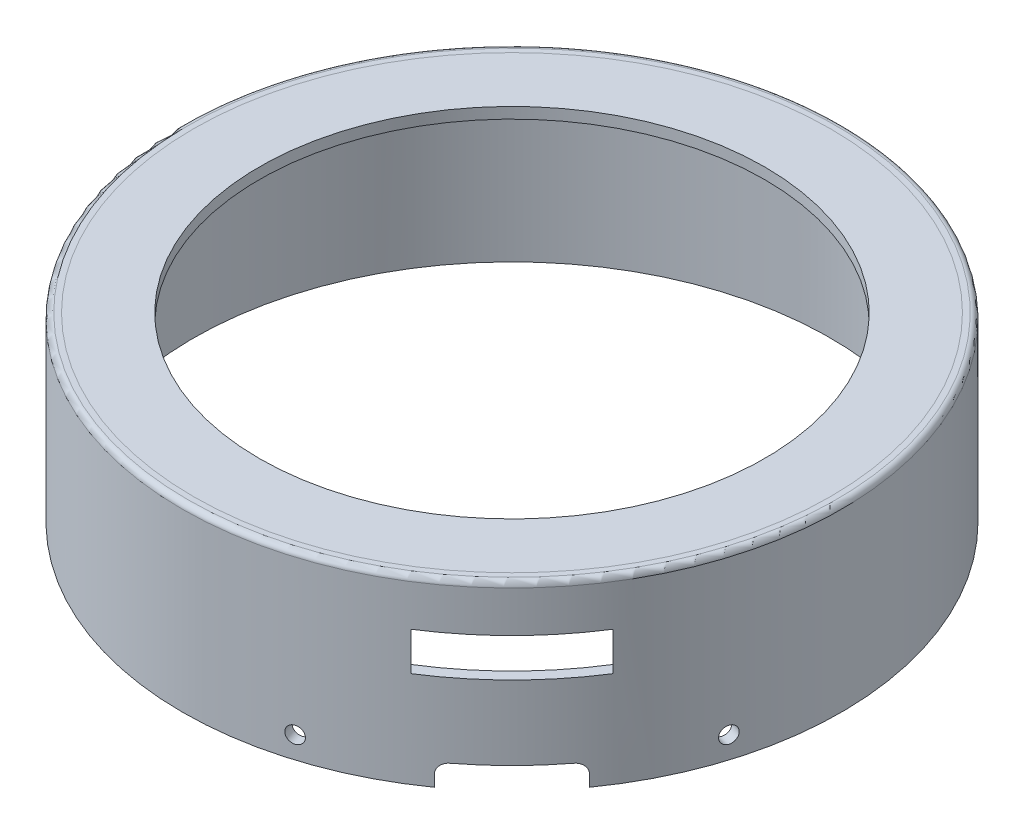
ISO-10303-21;
HEADER;
FILE_DESCRIPTION(('STEP AP214'),'2;1');
FILE_NAME('part.step','',(''),(''),'','','');
FILE_SCHEMA(('AUTOMOTIVE_DESIGN { 1 0 10303 214 1 1 1 1 }'));
ENDSEC;
DATA;
#1=APPLICATION_CONTEXT('core data for automotive mechanical design processes');
#2=APPLICATION_PROTOCOL_DEFINITION('international standard','automotive_design',2000,#1);
#3=PRODUCT_CONTEXT('',#1,'mechanical');
#4=PRODUCT('Part','Part','',(#3));
#5=PRODUCT_RELATED_PRODUCT_CATEGORY('part','',(#4));
#6=PRODUCT_DEFINITION_FORMATION('','',#4);
#7=PRODUCT_DEFINITION_CONTEXT('part definition',#1,'design');
#8=PRODUCT_DEFINITION('design','',#6,#7);
#9=PRODUCT_DEFINITION_SHAPE('','',#8);
#10=(LENGTH_UNIT() NAMED_UNIT(*) SI_UNIT(.MILLI.,.METRE.));
#11=(NAMED_UNIT(*) PLANE_ANGLE_UNIT() SI_UNIT($,.RADIAN.));
#12=(NAMED_UNIT(*) SI_UNIT($,.STERADIAN.) SOLID_ANGLE_UNIT());
#13=UNCERTAINTY_MEASURE_WITH_UNIT(LENGTH_MEASURE(1.E-05),#10,'distance_accuracy_value','');
#14=(GEOMETRIC_REPRESENTATION_CONTEXT(3) GLOBAL_UNCERTAINTY_ASSIGNED_CONTEXT((#13)) GLOBAL_UNIT_ASSIGNED_CONTEXT((#10,
#11,#12)) REPRESENTATION_CONTEXT('',''));
#15=CARTESIAN_POINT('',(0.,0.,0.));
#16=DIRECTION('',(0.,0.,1.));
#17=DIRECTION('',(1.,0.,0.));
#18=AXIS2_PLACEMENT_3D('',#15,#16,#17);
#19=CARTESIAN_POINT('',(0.,-31.,0.));
#20=DIRECTION('',(0.,1.,0.));
#21=DIRECTION('',(0.,0.,1.));
#22=AXIS2_PLACEMENT_3D('',#19,#20,#21);
#23=CYLINDRICAL_SURFACE('',#22,60.);
#24=DIRECTION('',(0.,1.,0.));
#25=VECTOR('',#24,1.);
#26=CARTESIAN_POINT('',(50.6109830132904,-31.,32.2262067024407));
#27=LINE('',#26,#25);
#28=CARTESIAN_POINT('',(50.6109830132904,-6.50000000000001,32.2262067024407));
#29=VERTEX_POINT('',#28);
#30=CARTESIAN_POINT('',(50.6109830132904,-13.5,32.2262067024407));
#31=VERTEX_POINT('',#30);
#32=EDGE_CURVE('E146',#29,#31,#27,.F.);
#33=ORIENTED_EDGE('',*,*,#32,.T.);
#34=CARTESIAN_POINT('',(0.,-13.5,0.));
#35=DIRECTION('',(0.,-1.,0.));
#36=DIRECTION('',(1.,0.,0.));
#37=AXIS2_PLACEMENT_3D('',#34,#35,#36);
#38=CIRCLE('',#37,60.);
#39=CARTESIAN_POINT('',(32.2262067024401,-13.5,50.6109830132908));
#40=VERTEX_POINT('',#39);
#41=EDGE_CURVE('E150',#31,#40,#38,.T.);
#42=ORIENTED_EDGE('',*,*,#41,.T.);
#43=DIRECTION('',(0.,1.,0.));
#44=VECTOR('',#43,1.);
#45=CARTESIAN_POINT('',(32.2262067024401,-31.,50.6109830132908));
#46=LINE('',#45,#44);
#47=CARTESIAN_POINT('',(32.2262067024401,-6.5,50.6109830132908));
#48=VERTEX_POINT('',#47);
#49=EDGE_CURVE('E139',#40,#48,#46,.T.);
#50=ORIENTED_EDGE('',*,*,#49,.T.);
#51=CARTESIAN_POINT('',(0.,-6.5,0.));
#52=DIRECTION('',(0.,1.,0.));
#53=DIRECTION('',(-1.,0.,0.));
#54=AXIS2_PLACEMENT_3D('',#51,#52,#53);
#55=CIRCLE('',#54,60.);
#56=EDGE_CURVE('E124',#48,#29,#55,.T.);
#57=ORIENTED_EDGE('',*,*,#56,.T.);
#58=EDGE_LOOP('',(#33,#42,#50,#57));
#59=FACE_BOUND('',#58,.T.);
#60=DIRECTION('',(0.,1.,0.));
#61=VECTOR('',#60,1.);
#62=CARTESIAN_POINT('',(48.9040691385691,-31.,34.7619335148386));
#63=LINE('',#62,#61);
#64=CARTESIAN_POINT('',(48.9040691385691,-29.,34.7619335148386));
#65=VERTEX_POINT('',#64);
#66=CARTESIAN_POINT('',(48.9040691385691,-31.,34.7619335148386));
#67=VERTEX_POINT('',#66);
#68=EDGE_CURVE('E203',#65,#67,#63,.F.);
#69=ORIENTED_EDGE('',*,*,#68,.T.);
#70=CARTESIAN_POINT('',(0.,-31.,0.));
#71=DIRECTION('',(0.,1.,0.));
#72=DIRECTION('',(0.,0.,1.));
#73=AXIS2_PLACEMENT_3D('',#70,#71,#72);
#74=CIRCLE('',#73,60.);
#75=CARTESIAN_POINT('',(34.761933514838,-31.,48.9040691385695));
#76=VERTEX_POINT('',#75);
#77=EDGE_CURVE('E322',#67,#76,#74,.T.);
#78=ORIENTED_EDGE('',*,*,#77,.T.);
#79=DIRECTION('',(0.,1.,0.));
#80=VECTOR('',#79,1.);
#81=CARTESIAN_POINT('',(34.761933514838,-31.,48.9040691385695));
#82=LINE('',#81,#80);
#83=CARTESIAN_POINT('',(34.761933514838,-29.,48.9040691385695));
#84=VERTEX_POINT('',#83);
#85=EDGE_CURVE('E363',#76,#84,#82,.T.);
#86=ORIENTED_EDGE('',*,*,#85,.T.);
#87=CARTESIAN_POINT('',(34.761933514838,-29.,48.9040691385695));
#88=CARTESIAN_POINT('',(34.7619331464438,-28.9442682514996,48.9040688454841));
#89=CARTESIAN_POINT('',(34.7638604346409,-28.8885634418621,48.9026995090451));
#90=CARTESIAN_POINT('',(34.7715447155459,-28.777557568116,48.8972362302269));
#91=CARTESIAN_POINT('',(34.7773013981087,-28.7222564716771,48.8931425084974));
#92=CARTESIAN_POINT('',(34.800245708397,-28.5576986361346,48.8768173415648));
#93=CARTESIAN_POINT('',(34.8231078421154,-28.4495524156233,48.860541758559));
#94=CARTESIAN_POINT('',(34.8832250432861,-28.2395223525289,48.8176398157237));
#95=CARTESIAN_POINT('',(34.9204847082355,-28.1376405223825,48.7910101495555));
#96=CARTESIAN_POINT('',(35.0081982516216,-27.942931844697,48.728112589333));
#97=CARTESIAN_POINT('',(35.0586515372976,-27.8501045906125,48.6918451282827));
#98=CARTESIAN_POINT('',(35.171565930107,-27.675434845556,48.6103468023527));
#99=CARTESIAN_POINT('',(35.2341064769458,-27.5936714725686,48.565056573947));
#100=CARTESIAN_POINT('',(35.3690833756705,-27.444051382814,48.4668432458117));
#101=CARTESIAN_POINT('',(35.4415220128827,-27.3761978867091,48.4139183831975));
#102=CARTESIAN_POINT('',(35.5951264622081,-27.2554421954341,48.3010989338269));
#103=CARTESIAN_POINT('',(35.6763919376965,-27.2027420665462,48.2411239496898));
#104=CARTESIAN_POINT('',(35.8444895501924,-27.114899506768,48.1163537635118));
#105=CARTESIAN_POINT('',(35.9313190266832,-27.0797487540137,48.0515608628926));
#106=CARTESIAN_POINT('',(36.0806300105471,-27.0359641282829,47.9394822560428));
#107=CARTESIAN_POINT('',(36.1423290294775,-27.022490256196,47.8929851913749));
#108=CARTESIAN_POINT('',(36.2662880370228,-27.00450834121,47.7991888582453));
#109=CARTESIAN_POINT('',(36.3285471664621,-26.9999883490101,47.7518907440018));
#110=CARTESIAN_POINT('',(36.3907378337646,-27.,47.7044463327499));
#111=B_SPLINE_CURVE_WITH_KNOTS('',3,(#87,#88,#89,#90,#91,#92,#93,#94,#95,#96,#97,#98,#99,#100,
#101,#102,#103,#104,#105,#106,#107,#108,#109,#110),.UNSPECIFIED.,.F.,.F.,(4,2,2,2,2,2,2,2,2,2,2,
4),(0.,0.167091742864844,0.33416995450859,0.667630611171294,1.00119783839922,1.33475008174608,
1.67057400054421,2.00647558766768,2.3466681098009,2.68669916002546,2.9214817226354,
3.15595074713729),.UNSPECIFIED.);
#112=CARTESIAN_POINT('',(36.3907378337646,-27.,47.7044463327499));
#113=VERTEX_POINT('',#112);
#114=EDGE_CURVE('E133',#84,#113,#111,.T.);
#115=ORIENTED_EDGE('',*,*,#114,.T.);
#116=CARTESIAN_POINT('',(0.,-27.,0.));
#117=DIRECTION('',(0.,1.,0.));
#118=DIRECTION('',(-1.,0.,0.));
#119=AXIS2_PLACEMENT_3D('',#116,#117,#118);
#120=CIRCLE('',#119,60.);
#121=CARTESIAN_POINT('',(47.7044463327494,-27.,36.3907378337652));
#122=VERTEX_POINT('',#121);
#123=EDGE_CURVE('E192',#113,#122,#120,.T.);
#124=ORIENTED_EDGE('',*,*,#123,.T.);
#125=CARTESIAN_POINT('',(47.7044463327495,-27.,36.3907378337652));
#126=CARTESIAN_POINT('',(47.7392001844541,-27.0000006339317,36.3451799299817));
#127=CARTESIAN_POINT('',(47.7738711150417,-27.0024202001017,36.2995937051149));
#128=CARTESIAN_POINT('',(47.8428360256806,-27.0120689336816,36.2086493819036));
#129=CARTESIAN_POINT('',(47.8771300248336,-27.0192978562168,36.1632912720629));
#130=CARTESIAN_POINT('',(47.9790348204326,-27.0481282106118,36.0281125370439));
#131=CARTESIAN_POINT('',(48.0457723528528,-27.0768734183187,35.9390512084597));
#132=CARTESIAN_POINT('',(48.1749496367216,-27.1526226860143,35.7657091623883));
#133=CARTESIAN_POINT('',(48.2373873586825,-27.1996352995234,35.6814307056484));
#134=CARTESIAN_POINT('',(48.3562778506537,-27.3106251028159,35.5201411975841));
#135=CARTESIAN_POINT('',(48.4127318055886,-27.3745989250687,35.443128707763));
#136=CARTESIAN_POINT('',(48.5180246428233,-27.5176080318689,35.2988563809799));
#137=CARTESIAN_POINT('',(48.5668792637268,-27.5966114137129,35.2315764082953));
#138=CARTESIAN_POINT('',(48.655805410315,-27.7676009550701,35.1086651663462));
#139=CARTESIAN_POINT('',(48.6958755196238,-27.8595892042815,35.0530357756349));
#140=CARTESIAN_POINT('',(48.7657710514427,-28.0529586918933,34.9557311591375));
#141=CARTESIAN_POINT('',(48.7956932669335,-28.1542387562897,34.9139241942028));
#142=CARTESIAN_POINT('',(48.8449946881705,-28.3640430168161,34.8449179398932));
#143=CARTESIAN_POINT('',(48.8643820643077,-28.4725615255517,34.8177073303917));
#144=CARTESIAN_POINT('',(48.8868263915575,-28.6515588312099,34.7861814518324));
#145=CARTESIAN_POINT('',(48.8932893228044,-28.7208238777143,34.7770952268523));
#146=CARTESIAN_POINT('',(48.9019094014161,-28.8600485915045,34.7649719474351));
#147=CARTESIAN_POINT('',(48.9040725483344,-28.9300071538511,34.7619264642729));
#148=CARTESIAN_POINT('',(48.9040691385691,-29.,34.7619335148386));
#149=B_SPLINE_CURVE_WITH_KNOTS('',3,(#125,#126,#127,#128,#129,#130,#131,#132,#133,#134,#135,
#136,#137,#138,#139,#140,#141,#142,#143,#144,#145,#146,#147,#148),.UNSPECIFIED.,.F.,.F.,(4,2,2,
2,2,2,2,2,2,2,2,4),(0.,0.171795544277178,0.34358234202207,0.686648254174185,1.02987499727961,
1.37303364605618,1.71547185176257,2.05796523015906,2.39709336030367,2.73595809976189,
2.94606363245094,3.15587579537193),.UNSPECIFIED.);
#150=EDGE_CURVE('E195',#122,#65,#149,.T.);
#151=ORIENTED_EDGE('',*,*,#150,.T.);
#152=EDGE_LOOP('',(#69,#78,#86,#115,#124,#151));
#153=FACE_BOUND('',#152,.T.);
#154=CARTESIAN_POINT('',(56.8363619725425,-27.,19.2257108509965));
#155=CARTESIAN_POINT('',(56.8363633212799,-26.9157584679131,19.2257073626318));
#156=CARTESIAN_POINT('',(56.8386455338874,-26.8314561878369,19.2189641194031));
#157=CARTESIAN_POINT('',(56.8477038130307,-26.6651743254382,19.1921537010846));
#158=CARTESIAN_POINT('',(56.8544852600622,-26.583197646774,19.1720705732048));
#159=CARTESIAN_POINT('',(56.8723065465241,-26.4239999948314,19.1191402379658));
#160=CARTESIAN_POINT('',(56.8833443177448,-26.3467767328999,19.0862992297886));
#161=CARTESIAN_POINT('',(56.909297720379,-26.199262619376,19.0087741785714));
#162=CARTESIAN_POINT('',(56.9242123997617,-26.1289700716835,18.9640930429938));
#163=CARTESIAN_POINT('',(56.9574231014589,-25.9972656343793,18.8641119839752));
#164=CARTESIAN_POINT('',(56.9757201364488,-25.9358564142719,18.8088088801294));
#165=CARTESIAN_POINT('',(57.0150883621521,-25.8236841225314,18.689132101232));
#166=CARTESIAN_POINT('',(57.0361596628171,-25.7729214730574,18.6247580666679));
#167=CARTESIAN_POINT('',(57.0803980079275,-25.6834807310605,18.4887336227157));
#168=CARTESIAN_POINT('',(57.1035652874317,-25.6448039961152,18.4170823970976));
#169=CARTESIAN_POINT('',(57.1512659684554,-25.5806419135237,18.2685215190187));
#170=CARTESIAN_POINT('',(57.1757993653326,-25.5551565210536,18.1916118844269));
#171=CARTESIAN_POINT('',(57.2254809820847,-25.5181056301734,18.0347190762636));
#172=CARTESIAN_POINT('',(57.2506290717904,-25.5065372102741,17.954736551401));
#173=CARTESIAN_POINT('',(57.3008075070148,-25.4976396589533,17.7939470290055));
#174=CARTESIAN_POINT('',(57.3258378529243,-25.5003104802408,17.7131400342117));
#175=CARTESIAN_POINT('',(57.3750698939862,-25.5198131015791,17.553016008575));
#176=CARTESIAN_POINT('',(57.3992717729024,-25.5366417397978,17.4736986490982));
#177=CARTESIAN_POINT('',(57.4461995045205,-25.5839774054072,17.3187966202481));
#178=CARTESIAN_POINT('',(57.4689253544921,-25.6144844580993,17.2432119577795));
#179=CARTESIAN_POINT('',(57.512316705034,-25.6883145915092,17.0979291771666));
#180=CARTESIAN_POINT('',(57.5329819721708,-25.7316391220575,17.0282317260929));
#181=CARTESIAN_POINT('',(57.571738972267,-25.8298732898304,16.8967327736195));
#182=CARTESIAN_POINT('',(57.5898307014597,-25.8847829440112,16.8349312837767));
#183=CARTESIAN_POINT('',(57.6230172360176,-26.004646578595,16.7209872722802));
#184=CARTESIAN_POINT('',(57.6381112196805,-26.0696033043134,16.6688473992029));
#185=CARTESIAN_POINT('',(57.6649525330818,-26.2077074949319,16.575753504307));
#186=CARTESIAN_POINT('',(57.6766998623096,-26.2808549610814,16.5347994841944));
#187=CARTESIAN_POINT('',(57.6965892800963,-26.4332657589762,16.46526343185));
#188=CARTESIAN_POINT('',(57.7047313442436,-26.5125291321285,16.4366814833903));
#189=CARTESIAN_POINT('',(57.7172352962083,-26.674921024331,16.3927202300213));
#190=CARTESIAN_POINT('',(57.721597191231,-26.7580495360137,16.3773408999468));
#191=CARTESIAN_POINT('',(57.7264480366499,-26.9257878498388,16.3602346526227));
#192=CARTESIAN_POINT('',(57.7269380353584,-27.0103972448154,16.3585040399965));
#193=CARTESIAN_POINT('',(57.7240375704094,-27.1787167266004,16.3687358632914));
#194=CARTESIAN_POINT('',(57.72064710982,-27.2624268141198,16.3806982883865));
#195=CARTESIAN_POINT('',(57.7100577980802,-27.4265607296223,16.4179657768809));
#196=CARTESIAN_POINT('',(57.7028594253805,-27.5069849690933,16.4432691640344));
#197=CARTESIAN_POINT('',(57.6848082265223,-27.6622768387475,16.5064827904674));
#198=CARTESIAN_POINT('',(57.6739553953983,-27.7371444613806,16.544393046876));
#199=CARTESIAN_POINT('',(57.6488296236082,-27.8792155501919,16.6317317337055));
#200=CARTESIAN_POINT('',(57.6345559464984,-27.9464173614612,16.6811626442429));
#201=CARTESIAN_POINT('',(57.6029115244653,-28.0712325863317,16.7901099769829));
#202=CARTESIAN_POINT('',(57.5855407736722,-28.1288459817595,16.8496264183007));
#203=CARTESIAN_POINT('',(57.548104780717,-28.2328617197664,16.9770444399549));
#204=CARTESIAN_POINT('',(57.5280389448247,-28.2792615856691,17.0449478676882));
#205=CARTESIAN_POINT('',(57.4857060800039,-28.359516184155,17.1871782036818));
#206=CARTESIAN_POINT('',(57.4634390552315,-28.3933709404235,17.2615050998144));
#207=CARTESIAN_POINT('',(57.4172754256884,-28.4475699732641,17.4144439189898));
#208=CARTESIAN_POINT('',(57.3933790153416,-28.4679158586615,17.4930553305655));
#209=CARTESIAN_POINT('',(57.3445925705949,-28.494524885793,17.652326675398));
#210=CARTESIAN_POINT('',(57.3197025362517,-28.5007880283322,17.7329866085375));
#211=CARTESIAN_POINT('',(57.2696300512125,-28.4990535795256,17.8940376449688));
#212=CARTESIAN_POINT('',(57.244447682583,-28.4910598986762,17.9744288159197));
#213=CARTESIAN_POINT('',(57.1945148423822,-28.4610467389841,18.1326876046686));
#214=CARTESIAN_POINT('',(57.169764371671,-28.4390272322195,18.2105552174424));
#215=CARTESIAN_POINT('',(57.1214405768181,-28.3815878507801,18.3615717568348));
#216=CARTESIAN_POINT('',(57.0978672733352,-28.3461677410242,18.4347206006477));
#217=CARTESIAN_POINT('',(57.052633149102,-28.2629344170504,18.5742411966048));
#218=CARTESIAN_POINT('',(57.0309722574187,-28.2151216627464,18.6406132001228));
#219=CARTESIAN_POINT('',(56.9902528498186,-28.1084505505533,18.7647370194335));
#220=CARTESIAN_POINT('',(56.971194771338,-28.0495903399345,18.8224873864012));
#221=CARTESIAN_POINT('',(56.9363073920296,-27.9224801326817,18.9277569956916));
#222=CARTESIAN_POINT('',(56.9204788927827,-27.8542278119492,18.9752736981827));
#223=CARTESIAN_POINT('',(56.8925801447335,-27.7102486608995,19.0587583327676));
#224=CARTESIAN_POINT('',(56.8805121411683,-27.6345174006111,19.0947193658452));
#225=CARTESIAN_POINT('',(56.8605704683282,-27.4778196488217,19.1540208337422));
#226=CARTESIAN_POINT('',(56.8526917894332,-27.396859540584,19.1773763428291));
#227=CARTESIAN_POINT('',(56.8434932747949,-27.2628221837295,19.2046188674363));
#228=CARTESIAN_POINT('',(56.84082300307,-27.2106152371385,19.2125186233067));
#229=CARTESIAN_POINT('',(56.837256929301,-27.1056134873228,19.2230657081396));
#230=CARTESIAN_POINT('',(56.8363611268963,-27.0528186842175,19.2257130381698));
#231=CARTESIAN_POINT('',(56.8363619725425,-27.,19.2257108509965));
#232=B_SPLINE_CURVE_WITH_KNOTS('',3,(#154,#155,#156,#157,#158,#159,#160,#161,#162,#163,#164,
#165,#166,#167,#168,#169,#170,#171,#172,#173,#174,#175,#176,#177,#178,#179,#180,#181,#182,#183,
#184,#185,#186,#187,#188,#189,#190,#191,#192,#193,#194,#195,#196,#197,#198,#199,#200,#201,#202,
#203,#204,#205,#206,#207,#208,#209,#210,#211,#212,#213,#214,#215,#216,#217,#218,#219,#220,#221,
#222,#223,#224,#225,#226,#227,#228,#229,#230,#231),.UNSPECIFIED.,.T.,.F.,(4,2,2,2,2,2,2,2,2,2,2,
2,2,2,2,2,2,2,2,2,2,2,2,2,2,2,2,2,2,2,2,2,2,2,2,2,2,2,4),(0.,0.252531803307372,
0.505366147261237,0.758077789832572,1.01072743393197,1.26345284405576,1.51618827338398,
1.76895208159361,2.02171503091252,2.27442491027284,2.52713395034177,2.77978656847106,
3.03243965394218,3.28512132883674,3.53780337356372,3.79055458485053,4.0433058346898,
4.29605879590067,4.54881127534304,4.80149531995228,5.05417916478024,5.30683126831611,
5.55948371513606,5.81219060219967,6.06489796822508,6.31766109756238,6.57042374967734,
6.82315629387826,7.0758888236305,7.32855204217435,7.58121576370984,7.83388391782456,
8.08654269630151,8.33924388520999,8.59200771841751,8.84492217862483,9.09753351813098,
9.25586872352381,9.41420389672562),.UNSPECIFIED.);
#233=CARTESIAN_POINT('',(56.8363619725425,-27.,19.2257108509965));
#234=VERTEX_POINT('',#233);
#235=EDGE_CURVE('E247',#234,#234,#232,.T.);
#236=ORIENTED_EDGE('',*,*,#235,.T.);
#237=EDGE_LOOP('',(#236));
#238=FACE_BOUND('',#237,.T.);
#239=CARTESIAN_POINT('',(16.3607488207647,-27.,57.7263016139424));
#240=CARTESIAN_POINT('',(16.3607524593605,-26.9157584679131,57.7263007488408));
#241=CARTESIAN_POINT('',(16.3676019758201,-26.8314561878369,57.7243606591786));
#242=CARTESIAN_POINT('',(16.394826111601,-26.6651743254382,57.7166342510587));
#243=CARTESIAN_POINT('',(16.4152169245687,-26.583197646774,57.7108433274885));
#244=CARTESIAN_POINT('',(16.4689289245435,-26.4239999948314,57.6955384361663));
#245=CARTESIAN_POINT('',(16.5022438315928,-26.3467767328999,57.6860262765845));
#246=CARTESIAN_POINT('',(16.5808294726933,-26.199262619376,57.6634872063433));
#247=CARTESIAN_POINT('',(16.6260972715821,-26.1289700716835,57.6504611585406));
#248=CARTESIAN_POINT('',(16.7272985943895,-25.9972656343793,57.6211788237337));
#249=CARTESIAN_POINT('',(16.7832353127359,-25.9358564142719,57.6049215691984));
#250=CARTESIAN_POINT('',(16.9041547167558,-25.8236841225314,57.569553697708));
#251=CARTESIAN_POINT('',(16.9691377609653,-25.7729214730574,57.550442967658));
#252=CARTESIAN_POINT('',(17.106287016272,-25.6834807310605,57.5098257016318));
#253=CARTESIAN_POINT('',(17.1784540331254,-25.6448039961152,57.488318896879));
#254=CARTESIAN_POINT('',(17.3278950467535,-25.5806419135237,57.4434516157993));
#255=CARTESIAN_POINT('',(17.4051690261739,-25.5551565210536,57.4200911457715));
#256=CARTESIAN_POINT('',(17.5625979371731,-25.5181056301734,57.372135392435));
#257=CARTESIAN_POINT('',(17.6427522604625,-25.5065372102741,57.3475403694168));
#258=CARTESIAN_POINT('',(17.8036735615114,-25.4976396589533,57.2977861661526));
#259=CARTESIAN_POINT('',(17.8844405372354,-25.5003104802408,57.2726269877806));
#260=CARTESIAN_POINT('',(18.0442772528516,-25.5198131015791,57.2224700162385));
#261=CARTESIAN_POINT('',(18.1233473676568,-25.5366417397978,57.1974721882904));
#262=CARTESIAN_POINT('',(18.2775755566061,-25.5839774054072,57.1483751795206));
#263=CARTESIAN_POINT('',(18.3527336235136,-25.6144844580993,57.1242760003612));
#264=CARTESIAN_POINT('',(18.4970318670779,-25.6883145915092,57.0777151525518));
#265=CARTESIAN_POINT('',(18.5661713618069,-25.7316391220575,57.055253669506));
#266=CARTESIAN_POINT('',(18.6964859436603,-25.8298732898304,57.0126838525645));
#267=CARTESIAN_POINT('',(18.7576610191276,-25.8847829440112,56.9925755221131));
#268=CARTESIAN_POINT('',(18.8703541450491,-26.004646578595,56.9553620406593));
#269=CARTESIAN_POINT('',(18.9218695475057,-26.0696033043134,56.9382577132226));
#270=CARTESIAN_POINT('',(19.013787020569,-26.2077074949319,56.9076291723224));
#271=CARTESIAN_POINT('',(19.0541890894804,-26.2808549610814,56.894104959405));
#272=CARTESIAN_POINT('',(19.122756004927,-26.4332657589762,56.8710956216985));
#273=CARTESIAN_POINT('',(19.1509207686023,-26.5125291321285,56.8616105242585));
#274=CARTESIAN_POINT('',(19.1942294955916,-26.674921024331,56.8470059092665));
#275=CARTESIAN_POINT('',(19.2093734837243,-26.7580495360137,56.8418863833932));
#276=CARTESIAN_POINT('',(19.2262174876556,-26.9257878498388,56.8361913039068));
#277=CARTESIAN_POINT('',(19.2279211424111,-27.0103972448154,56.8356145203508));
#278=CARTESIAN_POINT('',(19.217846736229,-27.1787167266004,56.8390217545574));
#279=CARTESIAN_POINT('',(19.2060686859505,-27.2624268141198,56.8430057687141));
#280=CARTESIAN_POINT('',(19.1693604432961,-27.4265607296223,56.8553954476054));
#281=CARTESIAN_POINT('',(19.1444319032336,-27.5069849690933,56.8638005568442));
#282=CARTESIAN_POINT('',(19.0821161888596,-27.6622768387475,56.8847423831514));
#283=CARTESIAN_POINT('',(19.0447289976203,-27.7371444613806,56.8972791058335));
#284=CARTESIAN_POINT('',(18.9585258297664,-27.8792155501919,56.926060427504));
#285=CARTESIAN_POINT('',(18.909707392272,-27.9464173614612,56.9423058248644));
#286=CARTESIAN_POINT('',(18.8020052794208,-28.0712325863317,56.9779589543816));
#287=CARTESIAN_POINT('',(18.7431215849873,-28.1288459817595,56.9973666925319));
#288=CARTESIAN_POINT('',(18.6169181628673,-28.2328617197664,57.0387128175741));
#289=CARTESIAN_POINT('',(18.5495965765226,-28.2792615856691,57.060651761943));
#290=CARTESIAN_POINT('',(18.4084132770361,-28.359516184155,57.1063553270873));
#291=CARTESIAN_POINT('',(18.3345515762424,-28.3933709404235,57.1301199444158));
#292=CARTESIAN_POINT('',(18.1823740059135,-28.4475699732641,57.1787342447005));
#293=CARTESIAN_POINT('',(18.1040586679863,-28.4679158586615,57.2035837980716));
#294=CARTESIAN_POINT('',(17.9451770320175,-28.494524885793,57.253624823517));
#295=CARTESIAN_POINT('',(17.8646107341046,-28.5007880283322,57.2788162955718));
#296=CARTESIAN_POINT('',(17.7035339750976,-28.4990535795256,57.3288059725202));
#297=CARTESIAN_POINT('',(17.6230235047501,-28.4910598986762,57.3536042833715));
#298=CARTESIAN_POINT('',(17.464326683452,-28.4610467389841,57.4021269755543));
#299=CARTESIAN_POINT('',(17.3861403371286,-28.4390272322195,57.4258513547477));
#300=CARTESIAN_POINT('',(17.2343228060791,-28.3815878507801,57.4715965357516));
#301=CARTESIAN_POINT('',(17.1606917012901,-28.3461677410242,57.4936173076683));
#302=CARTESIAN_POINT('',(17.0200974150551,-28.2629344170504,57.5353949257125));
#303=CARTESIAN_POINT('',(16.953133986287,-28.2151216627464,57.5551518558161));
#304=CARTESIAN_POINT('',(16.827784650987,-28.1084505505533,57.5919259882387));
#305=CARTESIAN_POINT('',(16.7694001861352,-28.0495903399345,57.6089427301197));
#306=CARTESIAN_POINT('',(16.6628911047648,-27.9224801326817,57.6398399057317));
#307=CARTESIAN_POINT('',(16.6147690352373,-27.8542278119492,57.6537195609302));
#308=CARTESIAN_POINT('',(16.5301704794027,-27.7102486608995,57.6780322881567));
#309=CARTESIAN_POINT('',(16.4937009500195,-27.6345174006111,57.6884633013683));
#310=CARTESIAN_POINT('',(16.433537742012,-27.4778196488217,57.7056307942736));
#311=CARTESIAN_POINT('',(16.409828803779,-27.396859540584,57.7123716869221));
#312=CARTESIAN_POINT('',(16.3821691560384,-27.2628221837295,57.7202273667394));
#313=CARTESIAN_POINT('',(16.3741468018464,-27.2106152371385,57.7225029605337));
#314=CARTESIAN_POINT('',(16.3634354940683,-27.1056134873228,57.7255403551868));
#315=CARTESIAN_POINT('',(16.3607465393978,-27.0528186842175,57.7263021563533));
#316=CARTESIAN_POINT('',(16.3607488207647,-27.,57.7263016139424));
#317=B_SPLINE_CURVE_WITH_KNOTS('',3,(#239,#240,#241,#242,#243,#244,#245,#246,#247,#248,#249,
#250,#251,#252,#253,#254,#255,#256,#257,#258,#259,#260,#261,#262,#263,#264,#265,#266,#267,#268,
#269,#270,#271,#272,#273,#274,#275,#276,#277,#278,#279,#280,#281,#282,#283,#284,#285,#286,#287,
#288,#289,#290,#291,#292,#293,#294,#295,#296,#297,#298,#299,#300,#301,#302,#303,#304,#305,#306,
#307,#308,#309,#310,#311,#312,#313,#314,#315,#316),.UNSPECIFIED.,.T.,.F.,(4,2,2,2,2,2,2,2,2,2,2,
2,2,2,2,2,2,2,2,2,2,2,2,2,2,2,2,2,2,2,2,2,2,2,2,2,2,2,4),(0.,0.252531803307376,
0.505366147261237,0.758077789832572,1.01072743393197,1.26345284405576,1.51618827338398,
1.76895208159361,2.02171503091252,2.27442491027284,2.52713395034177,2.77978656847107,
3.03243965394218,3.28512132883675,3.53780337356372,3.79055458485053,4.04330583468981,
4.29605879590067,4.54881127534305,4.80149531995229,5.05417916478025,5.30683126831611,
5.55948371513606,5.81219060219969,6.0648979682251,6.3176610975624,6.57042374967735,
6.82315629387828,7.07588882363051,7.32855204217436,7.58121576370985,7.83388391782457,
8.08654269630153,8.33924388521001,8.59200771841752,8.84492217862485,9.09753351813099,
9.25586872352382,9.41420389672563),.UNSPECIFIED.);
#318=CARTESIAN_POINT('',(16.3607488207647,-27.,57.7263016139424));
#319=VERTEX_POINT('',#318);
#320=EDGE_CURVE('E260',#319,#319,#317,.T.);
#321=ORIENTED_EDGE('',*,*,#320,.T.);
#322=EDGE_LOOP('',(#321));
#323=FACE_BOUND('',#322,.T.);
#324=CARTESIAN_POINT('',(-53.7275439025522,-7.,-26.7086320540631));
#325=CARTESIAN_POINT('',(-53.7275457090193,-7.08424153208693,-26.7086287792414));
#326=CARTESIAN_POINT('',(-53.7307157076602,-7.16854381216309,-26.7022545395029));
#327=CARTESIAN_POINT('',(-53.7433038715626,-7.33482567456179,-26.6769091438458));
#328=CARTESIAN_POINT('',(-53.7527295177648,-7.41680235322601,-26.657922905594));
#329=CARTESIAN_POINT('',(-53.7775202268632,-7.57600000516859,-26.6078765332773));
#330=CARTESIAN_POINT('',(-53.7928824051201,-7.65322326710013,-26.5768222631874));
#331=CARTESIAN_POINT('',(-53.8290450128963,-7.80073738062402,-26.5035011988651));
#332=CARTESIAN_POINT('',(-53.8498441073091,-7.87102992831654,-26.4612371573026));
#333=CARTESIAN_POINT('',(-53.896223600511,-8.00273436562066,-26.3666427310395));
#334=CARTESIAN_POINT('',(-53.9218054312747,-8.06414358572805,-26.3143093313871));
#335=CARTESIAN_POINT('',(-53.9769401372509,-8.17631587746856,-26.2010284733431));
#336=CARTESIAN_POINT('',(-54.006493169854,-8.22707852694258,-26.1400806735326));
#337=CARTESIAN_POINT('',(-54.0686563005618,-8.31651926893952,-26.0112574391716));
#338=CARTESIAN_POINT('',(-54.1012667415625,-8.35519600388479,-25.943381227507));
#339=CARTESIAN_POINT('',(-54.1685498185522,-8.41935808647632,-25.8026024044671));
#340=CARTESIAN_POINT('',(-54.2032224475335,-8.44484347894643,-25.7296998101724));
#341=CARTESIAN_POINT('',(-54.2735910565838,-8.4818943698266,-25.5809319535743));
#342=CARTESIAN_POINT('',(-54.309286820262,-8.49346278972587,-25.5050673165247));
#343=CARTESIAN_POINT('',(-54.3806727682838,-8.5023603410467,-25.3525052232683));
#344=CARTESIAN_POINT('',(-54.4163629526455,-8.49968951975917,-25.2758077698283));
#345=CARTESIAN_POINT('',(-54.4867214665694,-8.48018689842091,-25.1237775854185));
#346=CARTESIAN_POINT('',(-54.5213900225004,-8.46335826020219,-25.0484445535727));
#347=CARTESIAN_POINT('',(-54.588761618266,-8.41602259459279,-24.9012782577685));
#348=CARTESIAN_POINT('',(-54.6214646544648,-8.38551554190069,-24.8294450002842));
#349=CARTESIAN_POINT('',(-54.6840360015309,-8.31168540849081,-24.6913337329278));
#350=CARTESIAN_POINT('',(-54.7139039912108,-8.26836087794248,-24.6250563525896));
#351=CARTESIAN_POINT('',(-54.7700259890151,-8.17012671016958,-24.4999787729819));
#352=CARTESIAN_POINT('',(-54.7962799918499,-8.1152170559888,-24.4411785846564));
#353=CARTESIAN_POINT('',(-54.8445169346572,-7.99535342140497,-24.3327452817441));
#354=CARTESIAN_POINT('',(-54.8664987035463,-7.93039669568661,-24.2831146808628));
#355=CARTESIAN_POINT('',(-54.9056389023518,-7.79229250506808,-24.1944863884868));
#356=CARTESIAN_POINT('',(-54.9227973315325,-7.71914503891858,-24.1554886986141));
#357=CARTESIAN_POINT('',(-54.9518747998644,-7.56673424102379,-24.0892667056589));
#358=CARTESIAN_POINT('',(-54.963793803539,-7.48747086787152,-24.0620424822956));
#359=CARTESIAN_POINT('',(-54.9821071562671,-7.32507897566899,-24.0201669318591));
#360=CARTESIAN_POINT('',(-54.988501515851,-7.24195046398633,-24.005515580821));
#361=CARTESIAN_POINT('',(-54.9956130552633,-7.07421215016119,-23.9892189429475));
#362=CARTESIAN_POINT('',(-54.9963317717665,-6.98960275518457,-23.9875701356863));
#363=CARTESIAN_POINT('',(-54.9920791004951,-6.82128327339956,-23.9973178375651));
#364=CARTESIAN_POINT('',(-54.9871077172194,-6.73757318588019,-24.008714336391));
#365=CARTESIAN_POINT('',(-54.971593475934,-6.57343927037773,-24.0442151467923));
#366=CARTESIAN_POINT('',(-54.9610513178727,-6.4930150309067,-24.0683178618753));
#367=CARTESIAN_POINT('',(-54.9346472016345,-6.3377231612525,-24.1285227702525));
#368=CARTESIAN_POINT('',(-54.9187852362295,-6.26285553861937,-24.1646249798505));
#369=CARTESIAN_POINT('',(-54.8821204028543,-6.12078444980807,-24.2477817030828));
#370=CARTESIAN_POINT('',(-54.8613164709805,-6.05358263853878,-24.2948385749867));
#371=CARTESIAN_POINT('',(-54.8152808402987,-5.92876741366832,-24.398528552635));
#372=CARTESIAN_POINT('',(-54.7900491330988,-5.87115401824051,-24.4551616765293));
#373=CARTESIAN_POINT('',(-54.7357859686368,-5.76713828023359,-24.5763735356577));
#374=CARTESIAN_POINT('',(-54.7067536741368,-5.72073841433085,-24.6409540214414));
#375=CARTESIAN_POINT('',(-54.6456424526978,-5.64048381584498,-24.7761833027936));
#376=CARTESIAN_POINT('',(-54.6135635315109,-5.60662905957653,-24.8468320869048));
#377=CARTESIAN_POINT('',(-54.5472135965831,-5.55243002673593,-24.9921560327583));
#378=CARTESIAN_POINT('',(-54.5129428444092,-5.53208414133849,-25.0668307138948));
#379=CARTESIAN_POINT('',(-54.4431407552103,-5.50547511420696,-25.2180760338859));
#380=CARTESIAN_POINT('',(-54.4076094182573,-5.49921197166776,-25.2946466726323));
#381=CARTESIAN_POINT('',(-54.3362932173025,-5.50094642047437,-25.4474821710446));
#382=CARTESIAN_POINT('',(-54.3005084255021,-5.50894010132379,-25.5237471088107));
#383=CARTESIAN_POINT('',(-54.2297068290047,-5.53895326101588,-25.673834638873));
#384=CARTESIAN_POINT('',(-54.1946900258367,-5.56097276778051,-25.7476572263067));
#385=CARTESIAN_POINT('',(-54.1264586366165,-5.61841214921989,-25.890785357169));
#386=CARTESIAN_POINT('',(-54.0932440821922,-5.6538322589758,-25.9600908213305));
#387=CARTESIAN_POINT('',(-54.0296231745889,-5.73706558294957,-26.0922441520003));
#388=CARTESIAN_POINT('',(-53.9992167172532,-5.78487833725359,-26.1550922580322));
#389=CARTESIAN_POINT('',(-53.9421439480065,-5.89154944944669,-26.272597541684));
#390=CARTESIAN_POINT('',(-53.9154782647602,-5.95040966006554,-26.3272533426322));
#391=CARTESIAN_POINT('',(-53.8667247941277,-6.07751986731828,-26.4268621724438));
#392=CARTESIAN_POINT('',(-53.8446381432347,-6.14577218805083,-26.4718127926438));
#393=CARTESIAN_POINT('',(-53.8057449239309,-6.2897513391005,-26.5507769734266));
#394=CARTESIAN_POINT('',(-53.7889415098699,-6.36548259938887,-26.5847840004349));
#395=CARTESIAN_POINT('',(-53.7611912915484,-6.52218035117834,-26.6408577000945));
#396=CARTESIAN_POINT('',(-53.750237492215,-6.60314045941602,-26.6629386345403));
#397=CARTESIAN_POINT('',(-53.737452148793,-6.73717781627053,-26.6886933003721));
#398=CARTESIAN_POINT('',(-53.7337417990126,-6.7893847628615,-26.6961612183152));
#399=CARTESIAN_POINT('',(-53.7287871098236,-6.89438651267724,-26.7061316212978));
#400=CARTESIAN_POINT('',(-53.7275427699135,-6.94718131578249,-26.7086341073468));
#401=CARTESIAN_POINT('',(-53.7275439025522,-7.,-26.7086320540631));
#402=B_SPLINE_CURVE_WITH_KNOTS('',3,(#324,#325,#326,#327,#328,#329,#330,#331,#332,#333,#334,
#335,#336,#337,#338,#339,#340,#341,#342,#343,#344,#345,#346,#347,#348,#349,#350,#351,#352,#353,
#354,#355,#356,#357,#358,#359,#360,#361,#362,#363,#364,#365,#366,#367,#368,#369,#370,#371,#372,
#373,#374,#375,#376,#377,#378,#379,#380,#381,#382,#383,#384,#385,#386,#387,#388,#389,#390,#391,
#392,#393,#394,#395,#396,#397,#398,#399,#400,#401),.UNSPECIFIED.,.T.,.F.,(4,2,2,2,2,2,2,2,2,2,2,
2,2,2,2,2,2,2,2,2,2,2,2,2,2,2,2,2,2,2,2,2,2,2,2,2,2,2,4),(0.,0.252531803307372,
0.505366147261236,0.758077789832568,1.01072743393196,1.26345284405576,1.51618827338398,
1.76895208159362,2.02171503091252,2.27442491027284,2.52713395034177,2.77978656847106,
3.03243965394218,3.28512132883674,3.53780337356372,3.79055458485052,4.04330583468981,
4.29605879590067,4.54881127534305,4.80149531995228,5.05417916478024,5.3068312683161,
5.55948371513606,5.81219060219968,6.06489796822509,6.31766109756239,6.57042374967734,
6.82315629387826,7.0758888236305,7.32855204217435,7.58121576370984,7.83388391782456,
8.08654269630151,8.33924388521,8.59200771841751,8.84492217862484,9.09753351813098,
9.25586872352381,9.41420389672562),.UNSPECIFIED.);
#403=CARTESIAN_POINT('',(-53.7275439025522,-7.,-26.7086320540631));
#404=VERTEX_POINT('',#403);
#405=EDGE_CURVE('E312',#404,#404,#402,.T.);
#406=ORIENTED_EDGE('',*,*,#405,.F.);
#407=EDGE_LOOP('',(#406));
#408=FACE_BOUND('',#407,.T.);
#409=CARTESIAN_POINT('',(0.,1.,0.));
#410=DIRECTION('',(0.,1.,0.));
#411=DIRECTION('',(0.,0.,1.));
#412=AXIS2_PLACEMENT_3D('',#409,#410,#411);
#413=CIRCLE('',#412,60.);
#414=CARTESIAN_POINT('',(0.,1.,60.));
#415=VERTEX_POINT('',#414);
#416=EDGE_CURVE('E12',#415,#415,#413,.F.);
#417=ORIENTED_EDGE('',*,*,#416,.T.);
#418=EDGE_LOOP('',(#417));
#419=FACE_BOUND('',#418,.T.);
#420=CARTESIAN_POINT('',(-23.9897086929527,-7.,-54.9953986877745));
#421=CARTESIAN_POINT('',(-23.9897121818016,-7.08424153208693,-54.9953973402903));
#422=CARTESIAN_POINT('',(-23.9962378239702,-7.16854381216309,-54.9925520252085));
#423=CARTESIAN_POINT('',(-24.0221726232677,-7.33482567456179,-54.9812278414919));
#424=CARTESIAN_POINT('',(-24.0415972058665,-7.41680235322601,-54.9727422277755));
#425=CARTESIAN_POINT('',(-24.0927571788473,-7.57600000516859,-54.9503396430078));
#426=CARTESIAN_POINT('',(-24.1244865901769,-7.65322326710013,-54.9364253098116));
#427=CARTESIAN_POINT('',(-24.1993186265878,-7.80073738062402,-54.9035029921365));
#428=CARTESIAN_POINT('',(-24.2424184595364,-7.87102992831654,-54.884496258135));
#429=CARTESIAN_POINT('',(-24.3387513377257,-8.00273436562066,-54.8418448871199));
#430=CARTESIAN_POINT('',(-24.3919874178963,-8.06414358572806,-54.8181988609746));
#431=CARTESIAN_POINT('',(-24.5070385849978,-8.17631587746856,-54.7668605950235));
#432=CARTESIAN_POINT('',(-24.5688540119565,-8.22707852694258,-54.7391681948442));
#433=CARTESIAN_POINT('',(-24.6992797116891,-8.31651926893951,-54.6804415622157));
#434=CARTESIAN_POINT('',(-24.7678907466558,-8.35519600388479,-54.6494069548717));
#435=CARTESIAN_POINT('',(-24.909923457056,-8.41935808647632,-54.5848128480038));
#436=CARTESIAN_POINT('',(-24.9833451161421,-8.44484347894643,-54.5512533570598));
#437=CARTESIAN_POINT('',(-25.1328767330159,-8.4818943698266,-54.4825226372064));
#438=CARTESIAN_POINT('',(-25.2089861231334,-8.49346278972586,-54.447351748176));
#439=CARTESIAN_POINT('',(-25.3617359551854,-8.5023603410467,-54.3763684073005));
#440=CARTESIAN_POINT('',(-25.4383763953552,-8.49968951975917,-54.3405559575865));
#441=CARTESIAN_POINT('',(-25.5899972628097,-8.48018689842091,-54.2693196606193));
#442=CARTESIAN_POINT('',(-25.6649780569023,-8.46335826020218,-54.2338957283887));
#443=CARTESIAN_POINT('',(-25.811184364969,-8.41602259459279,-54.1644654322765));
#444=CARTESIAN_POINT('',(-25.8824098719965,-8.38551554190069,-54.1304590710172));
#445=CARTESIAN_POINT('',(-26.0191185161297,-8.31168540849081,-54.0648797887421));
#446=CARTESIAN_POINT('',(-26.0846010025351,-8.26836087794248,-54.0333071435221));
#447=CARTESIAN_POINT('',(-26.2079912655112,-8.17012671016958,-53.9735666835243));
#448=CARTESIAN_POINT('',(-26.2658990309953,-8.1152170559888,-53.94539887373));
#449=CARTESIAN_POINT('',(-26.3725502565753,-7.99535342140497,-53.8933402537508));
#450=CARTESIAN_POINT('',(-26.4212912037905,-7.93039669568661,-53.8694506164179));
#451=CARTESIAN_POINT('',(-26.5082435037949,-7.79229250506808,-53.826716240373));
#452=CARTESIAN_POINT('',(-26.5464548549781,-7.71914503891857,-53.8078715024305));
#453=CARTESIAN_POINT('',(-26.611296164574,-7.56673424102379,-53.7758331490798));
#454=CARTESIAN_POINT('',(-26.6379260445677,-7.48747086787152,-53.7626395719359));
#455=CARTESIAN_POINT('',(-26.6788719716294,-7.32507897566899,-53.7423326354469));
#456=CARTESIAN_POINT('',(-26.6931880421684,-7.24195046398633,-53.7352192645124));
#457=CARTESIAN_POINT('',(-26.7091110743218,-7.07421215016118,-53.727306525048));
#458=CARTESIAN_POINT('',(-26.7107214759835,-6.98960275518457,-53.7265054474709));
#459=CARTESIAN_POINT('',(-26.7011980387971,-6.82128327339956,-53.731239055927));
#460=CARTESIAN_POINT('',(-26.690064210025,-6.73757318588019,-53.7367737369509));
#461=CARTESIAN_POINT('',(-26.6553601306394,-6.57343927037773,-53.7539965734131));
#462=CARTESIAN_POINT('',(-26.6317914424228,-6.4930150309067,-53.7656839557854));
#463=CARTESIAN_POINT('',(-26.572865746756,-6.3377231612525,-53.7948313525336));
#464=CARTESIAN_POINT('',(-26.5375087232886,-6.26285553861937,-53.8122913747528));
#465=CARTESIAN_POINT('',(-26.4559697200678,-6.12078444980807,-53.8524254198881));
#466=CARTESIAN_POINT('',(-26.4097854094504,-6.05358263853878,-53.8751005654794));
#467=CARTESIAN_POINT('',(-26.3078694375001,-5.92876741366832,-53.9249405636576));
#468=CARTESIAN_POINT('',(-26.2521377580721,-5.87115401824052,-53.952105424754));
#469=CARTESIAN_POINT('',(-26.1326562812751,-5.76713828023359,-54.0100794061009));
#470=CARTESIAN_POINT('',(-26.0689047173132,-5.72073841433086,-54.0408893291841));
#471=CARTESIAN_POINT('',(-25.9351670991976,-5.64048381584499,-54.1051994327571));
#472=CARTESIAN_POINT('',(-25.865181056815,-5.60662905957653,-54.1386996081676));
#473=CARTESIAN_POINT('',(-25.7209416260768,-5.55243002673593,-54.2073752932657));
#474=CARTESIAN_POINT('',(-25.6466887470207,-5.53208414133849,-54.2425506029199));
#475=CARTESIAN_POINT('',(-25.4959986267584,-5.50547511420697,-54.3135433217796));
#476=CARTESIAN_POINT('',(-25.4195613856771,-5.49921197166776,-54.3493607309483));
#477=CARTESIAN_POINT('',(-25.2666892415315,-5.50094642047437,-54.4205983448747));
#478=CARTESIAN_POINT('',(-25.1902543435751,-5.50894010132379,-54.4560186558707));
#479=CARTESIAN_POINT('',(-25.0395427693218,-5.53895326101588,-54.5254819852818));
#480=CARTESIAN_POINT('',(-24.9652660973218,-5.56097276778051,-54.5595250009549));
#481=CARTESIAN_POINT('',(-24.8209968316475,-5.61841214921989,-54.6253092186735));
#482=CARTESIAN_POINT('',(-24.7510043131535,-5.6538322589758,-54.657050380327));
#483=CARTESIAN_POINT('',(-24.6173213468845,-5.73706558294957,-54.7173909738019));
#484=CARTESIAN_POINT('',(-24.553630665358,-5.78487833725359,-54.7459905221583));
#485=CARTESIAN_POINT('',(-24.434379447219,-5.89154944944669,-54.7993191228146));
#486=CARTESIAN_POINT('',(-24.3788202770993,-5.95040966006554,-54.8240475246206));
#487=CARTESIAN_POINT('',(-24.2774456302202,-6.07751986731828,-54.8690141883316));
#488=CARTESIAN_POINT('',(-24.2316325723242,-6.14577218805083,-54.8892513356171));
#489=CARTESIAN_POINT('',(-24.1510814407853,-6.2897513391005,-54.9247413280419));
#490=CARTESIAN_POINT('',(-24.1163499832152,-6.36548259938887,-54.9399911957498));
#491=CARTESIAN_POINT('',(-24.0590486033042,-6.52218035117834,-54.965108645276));
#492=CARTESIAN_POINT('',(-24.0364641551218,-6.60314045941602,-54.9749826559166));
#493=CARTESIAN_POINT('',(-24.0101152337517,-6.73717781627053,-54.9864936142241));
#494=CARTESIAN_POINT('',(-24.0024726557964,-6.7893847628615,-54.9898294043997));
#495=CARTESIAN_POINT('',(-23.9922682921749,-6.89438651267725,-54.9942823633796));
#496=CARTESIAN_POINT('',(-23.9897065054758,-6.94718131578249,-54.995399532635));
#497=CARTESIAN_POINT('',(-23.9897086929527,-7.,-54.9953986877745));
#498=B_SPLINE_CURVE_WITH_KNOTS('',3,(#420,#421,#422,#423,#424,#425,#426,#427,#428,#429,#430,
#431,#432,#433,#434,#435,#436,#437,#438,#439,#440,#441,#442,#443,#444,#445,#446,#447,#448,#449,
#450,#451,#452,#453,#454,#455,#456,#457,#458,#459,#460,#461,#462,#463,#464,#465,#466,#467,#468,
#469,#470,#471,#472,#473,#474,#475,#476,#477,#478,#479,#480,#481,#482,#483,#484,#485,#486,#487,
#488,#489,#490,#491,#492,#493,#494,#495,#496,#497),.UNSPECIFIED.,.T.,.F.,(4,2,2,2,2,2,2,2,2,2,2,
2,2,2,2,2,2,2,2,2,2,2,2,2,2,2,2,2,2,2,2,2,2,2,2,2,2,2,4),(0.,0.252531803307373,
0.505366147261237,0.758077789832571,1.01072743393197,1.26345284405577,1.51618827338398,
1.76895208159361,2.02171503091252,2.27442491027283,2.52713395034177,2.77978656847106,
3.03243965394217,3.28512132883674,3.53780337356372,3.79055458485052,4.0433058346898,
4.29605879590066,4.54881127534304,4.80149531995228,5.05417916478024,5.3068312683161,
5.55948371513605,5.81219060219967,6.06489796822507,6.31766109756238,6.57042374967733,
6.82315629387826,7.07588882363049,7.32855204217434,7.58121576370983,7.83388391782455,
8.0865426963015,8.33924388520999,8.59200771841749,8.84492217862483,9.09753351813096,
9.2558687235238,9.4142038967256),.UNSPECIFIED.);
#499=CARTESIAN_POINT('',(-23.9897086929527,-7.,-54.9953986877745));
#500=VERTEX_POINT('',#499);
#501=EDGE_CURVE('E286',#500,#500,#498,.T.);
#502=ORIENTED_EDGE('',*,*,#501,.F.);
#503=EDGE_LOOP('',(#502));
#504=FACE_BOUND('',#503,.T.);
#505=ADVANCED_FACE('F41',(#59,#153,#238,#323,#408,#419,#504),#23,.T.);
#506=CARTESIAN_POINT('',(0.,-31.,0.));
#507=DIRECTION('',(0.,1.,0.));
#508=DIRECTION('',(0.,0.,1.));
#509=AXIS2_PLACEMENT_3D('',#506,#507,#508);
#510=CYLINDRICAL_SURFACE('',#509,58.);
#511=CARTESIAN_POINT('',(0.,-13.5,0.));
#512=DIRECTION('',(0.,1.,0.));
#513=DIRECTION('',(-1.,0.,0.));
#514=AXIS2_PLACEMENT_3D('',#511,#512,#513);
#515=CIRCLE('',#514,58.);
#516=CARTESIAN_POINT('',(30.7763496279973,-13.5,49.161125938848));
#517=VERTEX_POINT('',#516);
#518=CARTESIAN_POINT('',(49.1611259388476,-13.5,30.7763496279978));
#519=VERTEX_POINT('',#518);
#520=EDGE_CURVE('E64',#517,#519,#515,.T.);
#521=ORIENTED_EDGE('',*,*,#520,.T.);
#522=DIRECTION('',(0.,1.,0.));
#523=VECTOR('',#522,1.);
#524=CARTESIAN_POINT('',(49.1611259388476,-31.,30.7763496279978));
#525=LINE('',#524,#523);
#526=CARTESIAN_POINT('',(49.1611259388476,-6.50000000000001,30.7763496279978));
#527=VERTEX_POINT('',#526);
#528=EDGE_CURVE('E138',#519,#527,#525,.T.);
#529=ORIENTED_EDGE('',*,*,#528,.T.);
#530=CARTESIAN_POINT('',(0.,-6.5,0.));
#531=DIRECTION('',(0.,-1.,0.));
#532=DIRECTION('',(1.,0.,0.));
#533=AXIS2_PLACEMENT_3D('',#530,#531,#532);
#534=CIRCLE('',#533,58.);
#535=CARTESIAN_POINT('',(30.7763496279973,-6.5,49.161125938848));
#536=VERTEX_POINT('',#535);
#537=EDGE_CURVE('E121',#527,#536,#534,.T.);
#538=ORIENTED_EDGE('',*,*,#537,.T.);
#539=DIRECTION('',(0.,1.,0.));
#540=VECTOR('',#539,1.);
#541=CARTESIAN_POINT('',(30.7763496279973,-31.,49.161125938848));
#542=LINE('',#541,#540);
#543=EDGE_CURVE('E130',#536,#517,#542,.F.);
#544=ORIENTED_EDGE('',*,*,#543,.T.);
#545=EDGE_LOOP('',(#521,#529,#538,#544));
#546=FACE_BOUND('',#545,.T.);
#547=CARTESIAN_POINT('',(0.,-31.,0.));
#548=DIRECTION('',(0.,1.,0.));
#549=DIRECTION('',(0.,0.,1.));
#550=AXIS2_PLACEMENT_3D('',#547,#548,#549);
#551=CIRCLE('',#550,58.);
#552=CARTESIAN_POINT('',(47.4690875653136,-31.,33.3269519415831));
#553=VERTEX_POINT('',#552);
#554=CARTESIAN_POINT('',(33.3269519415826,-31.,47.469087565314));
#555=VERTEX_POINT('',#554);
#556=EDGE_CURVE('E319',#553,#555,#551,.T.);
#557=ORIENTED_EDGE('',*,*,#556,.F.);
#558=DIRECTION('',(0.,1.,0.));
#559=VECTOR('',#558,1.);
#560=CARTESIAN_POINT('',(47.4690875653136,-31.,33.3269519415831));
#561=LINE('',#560,#559);
#562=CARTESIAN_POINT('',(47.4690875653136,-29.,33.3269519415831));
#563=VERTEX_POINT('',#562);
#564=EDGE_CURVE('E157',#553,#563,#561,.T.);
#565=ORIENTED_EDGE('',*,*,#564,.T.);
#566=CARTESIAN_POINT('',(47.4690875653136,-29.,33.3269519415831));
#567=CARTESIAN_POINT('',(47.4690872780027,-28.9443061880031,33.3269515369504));
#568=CARTESIAN_POINT('',(47.4677296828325,-28.8886393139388,33.3288861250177));
#569=CARTESIAN_POINT('',(47.4623132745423,-28.7777094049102,33.3365992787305));
#570=CARTESIAN_POINT('',(47.4582546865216,-28.7224463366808,33.3423775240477));
#571=CARTESIAN_POINT('',(47.4420700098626,-28.5580056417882,33.3654067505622));
#572=CARTESIAN_POINT('',(47.4259348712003,-28.4499383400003,33.3883524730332));
#573=CARTESIAN_POINT('',(47.383403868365,-28.2400637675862,33.4486828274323));
#574=CARTESIAN_POINT('',(47.357004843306,-28.1382584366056,33.4860719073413));
#575=CARTESIAN_POINT('',(47.29465151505,-27.9436912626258,33.5740798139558));
#576=CARTESIAN_POINT('',(47.2586975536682,-27.8509290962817,33.6246981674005));
#577=CARTESIAN_POINT('',(47.1778816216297,-27.6763274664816,33.7379956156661));
#578=CARTESIAN_POINT('',(47.1329566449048,-27.5945725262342,33.8007599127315));
#579=CARTESIAN_POINT('',(47.035525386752,-27.4449499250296,33.9362092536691));
#580=CARTESIAN_POINT('',(46.983017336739,-27.3770855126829,34.0088966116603));
#581=CARTESIAN_POINT('',(46.8710215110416,-27.2562253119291,34.1630873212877));
#582=CARTESIAN_POINT('',(46.8114481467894,-27.2034454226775,34.2446975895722));
#583=CARTESIAN_POINT('',(46.6874887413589,-27.1154387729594,34.4135051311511));
#584=CARTESIAN_POINT('',(46.6231049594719,-27.0802038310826,34.5006997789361));
#585=CARTESIAN_POINT('',(46.5115529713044,-27.0362111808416,34.6508485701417));
#586=CARTESIAN_POINT('',(46.4651710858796,-27.0226450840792,34.7130220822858));
#587=CARTESIAN_POINT('',(46.3715914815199,-27.0045395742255,34.837934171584));
#588=CARTESIAN_POINT('',(46.3243949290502,-26.9999881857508,34.9006718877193));
#589=CARTESIAN_POINT('',(46.277046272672,-27.,34.9633377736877));
#590=B_SPLINE_CURVE_WITH_KNOTS('',3,(#566,#567,#568,#569,#570,#571,#572,#573,#574,#575,#576,
#577,#578,#579,#580,#581,#582,#583,#584,#585,#586,#587,#588,#589),.UNSPECIFIED.,.F.,.F.,(4,2,2,
2,2,2,2,2,2,2,2,4),(0.,0.166977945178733,0.33394197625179,0.667164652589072,1.00049003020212,
1.3338034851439,1.66954589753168,2.00536674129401,2.34577751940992,2.68602941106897,
2.92177222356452,3.15720165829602),.UNSPECIFIED.);
#591=CARTESIAN_POINT('',(46.277046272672,-27.,34.9633377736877));
#592=VERTEX_POINT('',#591);
#593=EDGE_CURVE('E160',#563,#592,#590,.T.);
#594=ORIENTED_EDGE('',*,*,#593,.T.);
#595=CARTESIAN_POINT('',(0.,-27.,0.));
#596=DIRECTION('',(0.,-1.,0.));
#597=DIRECTION('',(1.,0.,0.));
#598=AXIS2_PLACEMENT_3D('',#595,#596,#597);
#599=CIRCLE('',#598,58.);
#600=CARTESIAN_POINT('',(34.9633377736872,-27.,46.2770462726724));
#601=VERTEX_POINT('',#600);
#602=EDGE_CURVE('E169',#592,#601,#599,.T.);
#603=ORIENTED_EDGE('',*,*,#602,.T.);
#604=CARTESIAN_POINT('',(34.9633377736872,-27.,46.2770462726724));
#605=CARTESIAN_POINT('',(34.9175600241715,-27.0000006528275,46.3116329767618));
#606=CARTESIAN_POINT('',(34.8717525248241,-27.0024233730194,46.3461341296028));
#607=CARTESIAN_POINT('',(34.7803642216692,-27.0120844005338,46.414755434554));
#608=CARTESIAN_POINT('',(34.734783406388,-27.0193224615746,46.448875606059));
#609=CARTESIAN_POINT('',(34.5989360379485,-27.048188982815,46.5502559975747));
#610=CARTESIAN_POINT('',(34.5094287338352,-27.0769699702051,46.6166386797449));
#611=CARTESIAN_POINT('',(34.3352094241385,-27.152813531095,46.7451082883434));
#612=CARTESIAN_POINT('',(34.2504996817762,-27.1998846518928,46.8071931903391));
#613=CARTESIAN_POINT('',(34.0883782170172,-27.3110158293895,46.9253932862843));
#614=CARTESIAN_POINT('',(34.0109650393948,-27.3750724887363,46.9815096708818));
#615=CARTESIAN_POINT('',(33.8659522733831,-27.5182627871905,47.0861473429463));
#616=CARTESIAN_POINT('',(33.7983309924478,-27.5973621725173,47.1346854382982));
#617=CARTESIAN_POINT('',(33.6748033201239,-27.7685670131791,47.2230177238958));
#618=CARTESIAN_POINT('',(33.61889878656,-27.8606745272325,47.2628105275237));
#619=CARTESIAN_POINT('',(33.5211687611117,-28.0542313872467,47.332175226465));
#620=CARTESIAN_POINT('',(33.4792010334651,-28.1555719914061,47.3618504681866));
#621=CARTESIAN_POINT('',(33.4099553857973,-28.3654994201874,47.4107233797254));
#622=CARTESIAN_POINT('',(33.3826658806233,-28.4740804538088,47.4299293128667));
#623=CARTESIAN_POINT('',(33.3511380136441,-28.6528839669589,47.4521001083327));
#624=CARTESIAN_POINT('',(33.3420750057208,-28.721888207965,47.4584673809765));
#625=CARTESIAN_POINT('',(33.3299826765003,-28.8605842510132,47.4669597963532));
#626=CARTESIAN_POINT('',(33.3269449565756,-28.9302749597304,47.4690908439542));
#627=CARTESIAN_POINT('',(33.3269519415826,-29.,47.469087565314));
#628=B_SPLINE_CURVE_WITH_KNOTS('',3,(#604,#605,#606,#607,#608,#609,#610,#611,#612,#613,#614,
#615,#616,#617,#618,#619,#620,#621,#622,#623,#624,#625,#626,#627),.UNSPECIFIED.,.F.,.F.,(4,2,2,
2,2,2,2,2,2,2,2,4),(0.,0.172017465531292,0.344026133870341,0.687539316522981,1.03121322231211,
1.37481844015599,1.71765040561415,2.06053668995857,2.39980753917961,2.7388102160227,
2.94811175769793,3.15712134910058),.UNSPECIFIED.);
#629=CARTESIAN_POINT('',(33.3269519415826,-29.,47.469087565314));
#630=VERTEX_POINT('',#629);
#631=EDGE_CURVE('E178',#601,#630,#628,.T.);
#632=ORIENTED_EDGE('',*,*,#631,.T.);
#633=DIRECTION('',(0.,1.,0.));
#634=VECTOR('',#633,1.);
#635=CARTESIAN_POINT('',(33.3269519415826,-31.,47.469087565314));
#636=LINE('',#635,#634);
#637=EDGE_CURVE('E185',#630,#555,#636,.F.);
#638=ORIENTED_EDGE('',*,*,#637,.T.);
#639=EDGE_LOOP('',(#557,#565,#594,#603,#632,#638));
#640=FACE_BOUND('',#639,.T.);
#641=CARTESIAN_POINT('',(55.8157091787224,-27.,15.7672638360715));
#642=CARTESIAN_POINT('',(55.8157083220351,-26.9157594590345,15.7672674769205));
#643=CARTESIAN_POINT('',(55.8137741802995,-26.8314581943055,15.7741186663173));
#644=CARTESIAN_POINT('',(55.8060709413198,-26.6651784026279,15.8013492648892));
#645=CARTESIAN_POINT('',(55.800297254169,-26.5832027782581,15.8217448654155));
#646=CARTESIAN_POINT('',(55.7850361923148,-26.4240072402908,15.8754688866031));
#647=CARTESIAN_POINT('',(55.7755506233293,-26.3467850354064,15.9087910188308));
#648=CARTESIAN_POINT('',(55.7530711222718,-26.1992728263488,15.9873926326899));
#649=CARTESIAN_POINT('',(55.7400780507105,-26.1289811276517,16.0326691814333));
#650=CARTESIAN_POINT('',(55.710864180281,-25.9972771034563,16.1338891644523));
#651=CARTESIAN_POINT('',(55.6946423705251,-25.9358675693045,16.1898359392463));
#652=CARTESIAN_POINT('',(55.6593440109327,-25.8236944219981,16.3107750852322));
#653=CARTESIAN_POINT('',(55.6402673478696,-25.7729312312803,16.3757678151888));
#654=CARTESIAN_POINT('',(55.5997128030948,-25.6834887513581,16.5129356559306));
#655=CARTESIAN_POINT('',(55.5782346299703,-25.6448109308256,16.5851116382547));
#656=CARTESIAN_POINT('',(55.5334160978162,-25.5806467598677,16.7345683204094));
#657=CARTESIAN_POINT('',(55.5100757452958,-25.5551603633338,16.8118490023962));
#658=CARTESIAN_POINT('',(55.4621498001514,-25.5181079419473,16.9692871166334));
#659=CARTESIAN_POINT('',(55.4375644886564,-25.5065387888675,17.0494438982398));
#660=CARTESIAN_POINT('',(55.3878179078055,-25.4976396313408,17.2103666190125));
#661=CARTESIAN_POINT('',(55.3626566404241,-25.5003095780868,17.2911325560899));
#662=CARTESIAN_POINT('',(55.3124843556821,-25.5198101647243,17.4509624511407));
#663=CARTESIAN_POINT('',(55.2874733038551,-25.5366374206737,17.5300268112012));
#664=CARTESIAN_POINT('',(55.2383398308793,-25.5839697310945,17.6842406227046));
#665=CARTESIAN_POINT('',(55.2142174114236,-25.6144748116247,17.7593900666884));
#666=CARTESIAN_POINT('',(55.1676024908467,-25.6883007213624,17.9036697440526));
#667=CARTESIAN_POINT('',(55.1451101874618,-25.7316231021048,17.9727992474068));
#668=CARTESIAN_POINT('',(55.1024747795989,-25.8298526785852,18.1030931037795));
#669=CARTESIAN_POINT('',(55.0823316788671,-25.884759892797,18.164257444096));
#670=CARTESIAN_POINT('',(55.0450482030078,-26.0046196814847,18.276930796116));
#671=CARTESIAN_POINT('',(55.0279087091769,-26.0695751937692,18.3284369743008));
#672=CARTESIAN_POINT('',(54.9972137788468,-26.2076773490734,18.4203374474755));
#673=CARTESIAN_POINT('',(54.9836583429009,-26.2808239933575,18.4607317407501));
#674=CARTESIAN_POINT('',(54.9605939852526,-26.4332336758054,18.5292855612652));
#675=CARTESIAN_POINT('',(54.9510850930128,-26.5124967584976,18.5574449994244));
#676=CARTESIAN_POINT('',(54.9364429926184,-26.6748885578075,18.6007461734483));
#677=CARTESIAN_POINT('',(54.9313097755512,-26.758017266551,18.615887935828));
#678=CARTESIAN_POINT('',(54.9255989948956,-26.9257547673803,18.6327307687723));
#679=CARTESIAN_POINT('',(54.9250201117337,-27.0103631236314,18.634435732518));
#680=CARTESIAN_POINT('',(54.9284347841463,-27.1786808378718,18.6243678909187));
#681=CARTESIAN_POINT('',(54.9324283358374,-27.2623901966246,18.6125950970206));
#682=CARTESIAN_POINT('',(54.9448475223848,-27.4265222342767,18.5759011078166));
#683=CARTESIAN_POINT('',(54.9532725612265,-27.5069453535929,18.5509816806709));
#684=CARTESIAN_POINT('',(54.9742623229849,-27.6622354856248,18.4886872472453));
#685=CARTESIAN_POINT('',(54.9868270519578,-27.737102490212,18.4513122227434));
#686=CARTESIAN_POINT('',(55.0156694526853,-27.8791741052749,18.3651346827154));
#687=CARTESIAN_POINT('',(55.0319479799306,-27.9463769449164,18.3163295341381));
#688=CARTESIAN_POINT('',(55.0676685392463,-28.0711947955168,18.208654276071));
#689=CARTESIAN_POINT('',(55.0871105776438,-28.1288097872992,18.1497841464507));
#690=CARTESIAN_POINT('',(55.1285229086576,-28.232830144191,18.0236057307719));
#691=CARTESIAN_POINT('',(55.1504937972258,-28.2792328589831,17.9562954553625));
#692=CARTESIAN_POINT('',(55.1962549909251,-28.3594933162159,17.815132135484));
#693=CARTESIAN_POINT('',(55.2200452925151,-28.3933510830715,17.7412791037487));
#694=CARTESIAN_POINT('',(55.2687015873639,-28.4475559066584,17.5891159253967));
#695=CARTESIAN_POINT('',(55.2935674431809,-28.4679046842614,17.5108063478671));
#696=CARTESIAN_POINT('',(55.3436300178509,-28.4945195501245,17.3519321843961));
#697=CARTESIAN_POINT('',(55.3688267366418,-28.500785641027,17.2713675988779));
#698=CARTESIAN_POINT('',(55.4188147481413,-28.4990570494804,17.110291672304));
#699=CARTESIAN_POINT('',(55.4436061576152,-28.4910665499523,17.0297803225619));
#700=CARTESIAN_POINT('',(55.4921041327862,-28.4610601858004,16.871077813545));
#701=CARTESIAN_POINT('',(55.5158106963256,-28.4390442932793,16.7928866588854));
#702=CARTESIAN_POINT('',(55.5615113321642,-28.3816125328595,16.6410561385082));
#703=CARTESIAN_POINT('',(55.583505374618,-28.3461964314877,16.5674168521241));
#704=CARTESIAN_POINT('',(55.6252236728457,-28.2629714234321,16.4268036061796));
#705=CARTESIAN_POINT('',(55.6449480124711,-28.2151629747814,16.3598294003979));
#706=CARTESIAN_POINT('',(55.6816551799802,-28.1084995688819,16.2344557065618));
#707=CARTESIAN_POINT('',(55.6986374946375,-28.049642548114,16.176057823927));
#708=CARTESIAN_POINT('',(55.7294675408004,-27.9225382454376,16.0695218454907));
#709=CARTESIAN_POINT('',(55.7433144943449,-27.8542886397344,16.0213862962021));
#710=CARTESIAN_POINT('',(55.7675674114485,-27.7103136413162,15.9367615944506));
#711=CARTESIAN_POINT('',(55.7779712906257,-27.6345837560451,15.9002794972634));
#712=CARTESIAN_POINT('',(55.7950931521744,-27.4778878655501,15.8400937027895));
#713=CARTESIAN_POINT('',(55.8018155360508,-27.3969282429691,15.8163747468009));
#714=CARTESIAN_POINT('',(55.8096504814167,-27.2628800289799,15.7886993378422));
#715=CARTESIAN_POINT('',(55.8119202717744,-27.2106617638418,15.7806713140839));
#716=CARTESIAN_POINT('',(55.8149498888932,-27.1056369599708,15.769952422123));
#717=CARTESIAN_POINT('',(55.8157097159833,-27.0528304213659,15.7672615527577));
#718=CARTESIAN_POINT('',(55.8157091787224,-27.,15.7672638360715));
#719=B_SPLINE_CURVE_WITH_KNOTS('',3,(#641,#642,#643,#644,#645,#646,#647,#648,#649,#650,#651,
#652,#653,#654,#655,#656,#657,#658,#659,#660,#661,#662,#663,#664,#665,#666,#667,#668,#669,#670,
#671,#672,#673,#674,#675,#676,#677,#678,#679,#680,#681,#682,#683,#684,#685,#686,#687,#688,#689,
#690,#691,#692,#693,#694,#695,#696,#697,#698,#699,#700,#701,#702,#703,#704,#705,#706,#707,#708,
#709,#710,#711,#712,#713,#714,#715,#716,#717,#718),.UNSPECIFIED.,.T.,.F.,(4,2,2,2,2,2,2,2,2,2,2,
2,2,2,2,2,2,2,2,2,2,2,2,2,2,2,2,2,2,2,2,2,2,2,2,2,2,2,4),(0.,0.252528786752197,
0.505359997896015,0.758068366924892,1.01071479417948,1.26344044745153,1.51617612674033,
1.76894250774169,2.0217080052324,2.27441667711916,2.52712448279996,2.77977190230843,
3.03241980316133,3.28509829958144,3.53777719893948,3.7905301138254,4.04328306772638,
4.29603786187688,4.54879214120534,4.80147318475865,5.05415401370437,5.3068008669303,
5.55944808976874,5.81215356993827,6.06485955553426,6.31762521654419,6.57039038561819,
6.8231233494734,7.07585626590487,7.32851504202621,7.58117432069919,7.83383800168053,
8.08649234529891,8.33919392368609,8.59195813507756,8.84487508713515,9.09748899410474,
9.25585935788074,9.41422968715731),.UNSPECIFIED.);
#720=CARTESIAN_POINT('',(55.8157091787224,-27.,15.7672638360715));
#721=VERTEX_POINT('',#720);
#722=EDGE_CURVE('E156',#721,#721,#719,.T.);
#723=ORIENTED_EDGE('',*,*,#722,.T.);
#724=EDGE_LOOP('',(#723));
#725=FACE_BOUND('',#724,.T.);
#726=CARTESIAN_POINT('',(18.6322258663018,-27.,54.9257695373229));
#727=CARTESIAN_POINT('',(18.632222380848,-26.9157594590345,54.9257708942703));
#728=CARTESIAN_POINT('',(18.6254811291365,-26.8314581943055,54.9280589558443));
#729=CARTESIAN_POINT('',(18.5986785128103,-26.6651784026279,54.9371399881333));
#730=CARTESIAN_POINT('',(18.5786012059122,-26.5832027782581,54.9439383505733));
#731=CARTESIAN_POINT('',(18.5256857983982,-26.4240072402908,54.9618025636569));
#732=CARTESIAN_POINT('',(18.4928539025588,-26.3467850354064,54.972866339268));
#733=CARTESIAN_POINT('',(18.4153494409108,-26.1992728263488,54.9988778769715));
#734=CARTESIAN_POINT('',(18.3706797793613,-26.1289811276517,55.013824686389));
#735=CARTESIAN_POINT('',(18.2707221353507,-25.9972771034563,55.0471023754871));
#736=CARTESIAN_POINT('',(18.2154308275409,-25.9358675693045,55.0654343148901));
#737=CARTESIAN_POINT('',(18.0957771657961,-25.8236944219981,55.1048710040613));
#738=CARTESIAN_POINT('',(18.0314144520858,-25.7729312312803,55.1259758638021));
#739=CARTESIAN_POINT('',(17.8954102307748,-25.6834887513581,55.1702764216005));
#740=CARTESIAN_POINT('',(17.8237678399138,-25.6448109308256,55.1934723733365));
#741=CARTESIAN_POINT('',(17.67522167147,-25.5806467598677,55.241222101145));
#742=CARTESIAN_POINT('',(17.5983179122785,-25.5551603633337,55.2657758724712));
#743=CARTESIAN_POINT('',(17.4414344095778,-25.5181079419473,55.3154872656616));
#744=CARTESIAN_POINT('',(17.3614553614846,-25.5065387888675,55.3406447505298));
#745=CARTESIAN_POINT('',(17.2006689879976,-25.4976396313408,55.3908302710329));
#746=CARTESIAN_POINT('',(17.119861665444,-25.5003095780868,55.4158583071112));
#747=CARTESIAN_POINT('',(16.9597345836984,-25.5198101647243,55.4650738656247));
#748=CARTESIAN_POINT('',(16.8804144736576,-25.5366374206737,55.4892615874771));
#749=CARTESIAN_POINT('',(16.7255036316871,-25.5839697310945,55.5361511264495));
#750=CARTESIAN_POINT('',(16.6499129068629,-25.6144748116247,55.5588529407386));
#751=CARTESIAN_POINT('',(16.504614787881,-25.6883007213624,55.6021892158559));
#752=CARTESIAN_POINT('',(16.4349081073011,-25.7316231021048,55.6228234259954));
#753=CARTESIAN_POINT('',(16.3033890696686,-25.8298526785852,55.6615146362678));
#754=CARTESIAN_POINT('',(16.2415767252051,-25.884759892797,55.6795716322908));
#755=CARTESIAN_POINT('',(16.1276093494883,-26.0046196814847,55.7126892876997));
#756=CARTESIAN_POINT('',(16.0754571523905,-26.0695751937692,55.7277490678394));
#757=CARTESIAN_POINT('',(15.9823396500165,-26.2076773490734,55.7545260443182));
#758=CARTESIAN_POINT('',(15.9413743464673,-26.2808239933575,55.7662432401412));
#759=CARTESIAN_POINT('',(15.8718179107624,-26.4332336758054,55.7860799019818));
#760=CARTESIAN_POINT('',(15.8432268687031,-26.5124967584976,55.7941993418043));
#761=CARTESIAN_POINT('',(15.7992506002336,-26.6748885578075,55.8066681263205));
#762=CARTESIAN_POINT('',(15.7838653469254,-26.758017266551,55.8110174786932));
#763=CARTESIAN_POINT('',(15.7667511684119,-26.9257547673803,55.8158547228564));
#764=CARTESIAN_POINT('',(15.7650182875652,-27.0103631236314,55.8163437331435));
#765=CARTESIAN_POINT('',(15.775248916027,-27.1786808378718,55.8134531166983));
#766=CARTESIAN_POINT('',(15.7872124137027,-27.2623901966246,55.8100734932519));
#767=CARTESIAN_POINT('',(15.8244848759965,-27.4265222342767,55.7995165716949));
#768=CARTESIAN_POINT('',(15.8497920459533,-27.5069453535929,55.7923397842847));
#769=CARTESIAN_POINT('',(15.913015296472,-27.6622354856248,55.7743401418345));
#770=CARTESIAN_POINT('',(15.9509313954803,-27.737102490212,55.7635172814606));
#771=CARTESIAN_POINT('',(16.0382835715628,-27.8791741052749,55.7384563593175));
#772=CARTESIAN_POINT('',(16.0877223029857,-27.9463769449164,55.7242175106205));
#773=CARTESIAN_POINT('',(16.1966857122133,-28.0711947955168,55.692643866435));
#774=CARTESIAN_POINT('',(16.2562104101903,-28.1288097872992,55.6753090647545));
#775=CARTESIAN_POINT('',(16.3836453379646,-28.232830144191,55.6379417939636));
#776=CARTESIAN_POINT('',(16.4515575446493,-28.2792328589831,55.6179086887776));
#777=CARTESIAN_POINT('',(16.5938040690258,-28.3594933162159,55.5756346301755));
#778=CARTESIAN_POINT('',(16.6681383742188,-28.3933510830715,55.5533936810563));
#779=CARTESIAN_POINT('',(16.8210891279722,-28.4475559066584,55.5072728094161));
#780=CARTESIAN_POINT('',(16.8997050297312,-28.4679046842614,55.4833930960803));
#781=CARTESIAN_POINT('',(17.0589824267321,-28.4945195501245,55.4346286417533));
#782=CARTESIAN_POINT('',(17.1396439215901,-28.500785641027,55.4097439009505));
#783=CARTESIAN_POINT('',(17.3006933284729,-28.4990570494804,55.3596705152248));
#784=CARTESIAN_POINT('',(17.3810813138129,-28.4910665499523,55.334481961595));
#785=CARTESIAN_POINT('',(17.5393307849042,-28.4610601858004,55.284525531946));
#786=CARTESIAN_POINT('',(17.6171922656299,-28.4390442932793,55.2597576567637));
#787=CARTESIAN_POINT('',(17.7681942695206,-28.3816125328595,55.2113897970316));
#788=CARTESIAN_POINT('',(17.8413347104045,-28.3461964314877,55.1877898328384));
#789=CARTESIAN_POINT('',(17.9808373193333,-28.2629714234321,55.1424960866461));
#790=CARTESIAN_POINT('',(18.047199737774,-28.2151629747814,55.1208022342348));
#791=CARTESIAN_POINT('',(18.1713056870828,-28.1084995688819,55.0800138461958));
#792=CARTESIAN_POINT('',(18.2290476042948,-28.049642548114,55.0609197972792));
#793=CARTESIAN_POINT('',(18.3343013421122,-27.9225382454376,55.0259618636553));
#794=CARTESIAN_POINT('',(18.3818106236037,-27.8542886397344,55.0100987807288));
#795=CARTESIAN_POINT('',(18.4652829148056,-27.7103136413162,54.9821359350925));
#796=CARTESIAN_POINT('',(18.5012389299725,-27.6345837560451,54.9700384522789));
#797=CARTESIAN_POINT('',(18.5605331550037,-27.4778878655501,54.9500463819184));
#798=CARTESIAN_POINT('',(18.5838864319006,-27.3969282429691,54.9421467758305));
#799=CARTESIAN_POINT('',(18.6111301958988,-27.2628800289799,54.9329222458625));
#800=CARTESIAN_POINT('',(18.6190313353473,-27.2106617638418,54.9302439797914));
#801=CARTESIAN_POINT('',(18.6295802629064,-27.1056369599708,54.926667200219));
#802=CARTESIAN_POINT('',(18.6322280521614,-27.0528304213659,54.92576868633));
#803=CARTESIAN_POINT('',(18.6322258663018,-27.,54.9257695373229));
#804=B_SPLINE_CURVE_WITH_KNOTS('',3,(#726,#727,#728,#729,#730,#731,#732,#733,#734,#735,#736,
#737,#738,#739,#740,#741,#742,#743,#744,#745,#746,#747,#748,#749,#750,#751,#752,#753,#754,#755,
#756,#757,#758,#759,#760,#761,#762,#763,#764,#765,#766,#767,#768,#769,#770,#771,#772,#773,#774,
#775,#776,#777,#778,#779,#780,#781,#782,#783,#784,#785,#786,#787,#788,#789,#790,#791,#792,#793,
#794,#795,#796,#797,#798,#799,#800,#801,#802,#803),.UNSPECIFIED.,.T.,.F.,(4,2,2,2,2,2,2,2,2,2,2,
2,2,2,2,2,2,2,2,2,2,2,2,2,2,2,2,2,2,2,2,2,2,2,2,2,2,2,4),(0.,0.252528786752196,
0.505359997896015,0.758068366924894,1.01071479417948,1.26344044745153,1.51617612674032,
1.76894250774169,2.02170800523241,2.27441667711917,2.52712448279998,2.77977190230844,
3.03241980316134,3.28509829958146,3.53777719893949,3.79053011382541,4.04328306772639,
4.29603786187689,4.54879214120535,4.80147318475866,5.05415401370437,5.30680086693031,
5.55944808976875,5.81215356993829,6.06485955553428,6.3176252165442,6.57039038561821,
6.82312334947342,7.07585626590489,7.32851504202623,7.58117432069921,7.83383800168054,
8.08649234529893,8.33919392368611,8.59195813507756,8.84487508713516,9.09748899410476,
9.25585935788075,9.41422968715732),.UNSPECIFIED.);
#805=CARTESIAN_POINT('',(18.6322258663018,-27.,54.9257695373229));
#806=VERTEX_POINT('',#805);
#807=EDGE_CURVE('E253',#806,#806,#804,.T.);
#808=ORIENTED_EDGE('',*,*,#807,.T.);
#809=EDGE_LOOP('',(#808));
#810=FACE_BOUND('',#809,.T.);
#811=CARTESIAN_POINT('',(0.,2.,0.));
#812=DIRECTION('',(0.,1.,0.));
#813=DIRECTION('',(0.,0.,1.));
#814=AXIS2_PLACEMENT_3D('',#811,#812,#813);
#815=CIRCLE('',#814,58.);
#816=CARTESIAN_POINT('',(0.,2.,58.));
#817=VERTEX_POINT('',#816);
#818=EDGE_CURVE('E318',#817,#817,#815,.T.);
#819=ORIENTED_EDGE('',*,*,#818,.T.);
#820=EDGE_LOOP('',(#819));
#821=FACE_BOUND('',#820,.T.);
#822=CARTESIAN_POINT('',(-53.1821968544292,-7.,-23.1441987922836));
#823=CARTESIAN_POINT('',(-53.182195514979,-7.08424054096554,-23.1442022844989));
#824=CARTESIAN_POINT('',(-53.1793558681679,-7.16854180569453,-23.1507303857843));
#825=CARTESIAN_POINT('',(-53.168053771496,-7.33482159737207,-23.1766747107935));
#826=CARTESIAN_POINT('',(-53.1595845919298,-7.41679722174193,-23.1961063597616));
#827=CARTESIAN_POINT('',(-53.1372238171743,-7.57599275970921,-23.2472841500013));
#828=CARTESIAN_POINT('',(-53.1233348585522,-7.65321496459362,-23.2790243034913));
#829=CARTESIAN_POINT('',(-53.0904694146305,-7.80072717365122,-23.3538801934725));
#830=CARTESIAN_POINT('',(-53.0714941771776,-7.87101887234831,-23.3969931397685));
#831=CARTESIAN_POINT('',(-53.0289081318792,-8.00272289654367,-23.4933537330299));
#832=CARTESIAN_POINT('',(-53.0052958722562,-8.0641324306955,-23.5466045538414));
#833=CARTESIAN_POINT('',(-52.9540238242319,-8.1763055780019,-23.6616846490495));
#834=CARTESIAN_POINT('',(-52.9263638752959,-8.22706876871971,-23.7235142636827));
#835=CARTESIAN_POINT('',(-52.8676968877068,-8.3165112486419,-23.8539668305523));
#836=CARTESIAN_POINT('',(-52.8366894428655,-8.35518906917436,-23.9225906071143));
#837=CARTESIAN_POINT('',(-52.7721415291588,-8.41935324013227,-24.0646454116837));
#838=CARTESIAN_POINT('',(-52.7386010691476,-8.44483963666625,-24.1380764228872));
#839=CARTESIAN_POINT('',(-52.6698986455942,-8.48189205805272,-24.287621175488));
#840=CARTESIAN_POINT('',(-52.6347370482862,-8.49346121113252,-24.3637343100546));
#841=CARTESIAN_POINT('',(-52.5637610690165,-8.50236036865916,-24.5164865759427));
#842=CARTESIAN_POINT('',(-52.5279466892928,-8.49969042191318,-24.5931257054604));
#843=CARTESIAN_POINT('',(-52.4566961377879,-8.48018983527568,-24.7447377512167));
#844=CARTESIAN_POINT('',(-52.4212598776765,-8.46336257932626,-24.8197110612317));
#845=CARTESIAN_POINT('',(-52.3517953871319,-8.41603026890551,-24.9658982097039));
#846=CARTESIAN_POINT('',(-52.3177671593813,-8.38552518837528,-25.0371120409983));
#847=CARTESIAN_POINT('',(-52.252136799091,-8.31169927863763,-25.1737950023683));
#848=CARTESIAN_POINT('',(-52.2205349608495,-8.26837689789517,-25.2392634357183));
#849=CARTESIAN_POINT('',(-52.1607323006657,-8.17014732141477,-25.3626243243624));
#850=CARTESIAN_POINT('',(-52.1325314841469,-8.11524010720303,-25.420516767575));
#851=CARTESIAN_POINT('',(-52.0804061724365,-7.99538031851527,-25.5271389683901));
#852=CARTESIAN_POINT('',(-52.0564829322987,-7.93042480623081,-25.5758660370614));
#853=CARTESIAN_POINT('',(-52.0136850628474,-7.7923226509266,-25.6627925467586));
#854=CARTESIAN_POINT('',(-51.9948104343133,-7.71917600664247,-25.7009919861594));
#855=CARTESIAN_POINT('',(-51.9627193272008,-7.56676632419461,-25.7658129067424));
#856=CARTESIAN_POINT('',(-51.9495028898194,-7.48750324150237,-25.7924343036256));
#857=CARTESIAN_POINT('',(-51.9291598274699,-7.32511144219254,-25.8333676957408));
#858=CARTESIAN_POINT('',(-51.9220331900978,-7.24198273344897,-25.847679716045));
#859=CARTESIAN_POINT('',(-51.9141050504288,-7.0742452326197,-25.863599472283));
#860=CARTESIAN_POINT('',(-51.9133017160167,-6.98963687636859,-25.8652108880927));
#861=CARTESIAN_POINT('',(-51.9180418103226,-6.82131916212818,-25.8556949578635));
#862=CARTESIAN_POINT('',(-51.9235852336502,-6.73760980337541,-25.8445676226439));
#863=CARTESIAN_POINT('',(-51.9408353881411,-6.5734777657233,-25.8098816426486));
#864=CARTESIAN_POINT('',(-51.9525412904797,-6.49305464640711,-25.7863246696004));
#865=CARTESIAN_POINT('',(-51.9817333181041,-6.33776451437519,-25.7274265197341));
#866=CARTESIAN_POINT('',(-51.9992194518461,-6.26289750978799,-25.6920853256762));
#867=CARTESIAN_POINT('',(-52.0394105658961,-6.12082589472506,-25.6105799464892));
#868=CARTESIAN_POINT('',(-52.0621167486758,-6.05362305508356,-25.5644132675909));
#869=CARTESIAN_POINT('',(-52.1120199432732,-5.92880520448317,-25.4625329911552));
#870=CARTESIAN_POINT('',(-52.1392169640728,-5.87119021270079,-25.4068193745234));
#871=CARTESIAN_POINT('',(-52.1972531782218,-5.76716985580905,-25.2873715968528));
#872=CARTESIAN_POINT('',(-52.2280932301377,-5.7207671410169,-25.2236355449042));
#873=CARTESIAN_POINT('',(-52.2924577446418,-5.64050668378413,-25.0899254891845));
#874=CARTESIAN_POINT('',(-52.3259822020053,-5.60664891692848,-25.019951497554));
#875=CARTESIAN_POINT('',(-52.3946975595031,-5.55244409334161,-24.8757319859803));
#876=CARTESIAN_POINT('',(-52.429888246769,-5.5320953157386,-24.8014870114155));
#877=CARTESIAN_POINT('',(-52.5009013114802,-5.50548044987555,-24.650807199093));
#878=CARTESIAN_POINT('',(-52.536723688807,-5.49921435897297,-24.5743723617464));
#879=CARTESIAN_POINT('',(-52.6079595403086,-5.50094295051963,-24.4215008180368));
#880=CARTESIAN_POINT('',(-52.6433731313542,-5.50893345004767,-24.3450641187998));
#881=CARTESIAN_POINT('',(-52.7128127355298,-5.53893981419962,-24.1943435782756));
#882=CARTESIAN_POINT('',(-52.7468387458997,-5.5609557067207,-24.1200597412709));
#883=CARTESIAN_POINT('',(-52.8125805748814,-5.61838746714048,-23.9757716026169));
#884=CARTESIAN_POINT('',(-52.8442963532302,-5.65380356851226,-23.9057673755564));
#885=CARTESIAN_POINT('',(-52.9045807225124,-5.73702857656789,-23.7720576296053));
#886=CARTESIAN_POINT('',(-52.9331494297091,-5.7848370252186,-23.7083518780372));
#887=CARTESIAN_POINT('',(-52.9864149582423,-5.89150043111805,-23.5890675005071));
#888=CARTESIAN_POINT('',(-53.0111110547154,-5.95035745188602,-23.5334903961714));
#889=CARTESIAN_POINT('',(-53.0560148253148,-6.07746175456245,-23.4320800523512));
#890=CARTESIAN_POINT('',(-53.0762213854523,-6.14571136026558,-23.3862492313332));
#891=CARTESIAN_POINT('',(-53.1116556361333,-6.2896863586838,-23.305664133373));
#892=CARTESIAN_POINT('',(-53.1268803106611,-6.36541624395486,-23.2709165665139));
#893=CARTESIAN_POINT('',(-53.1519555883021,-6.52211213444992,-23.213586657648));
#894=CARTESIAN_POINT('',(-53.1618126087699,-6.60307175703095,-23.1909897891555));
#895=CARTESIAN_POINT('',(-53.1733051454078,-6.73711997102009,-23.1646224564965));
#896=CARTESIAN_POINT('',(-53.1766359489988,-6.78933823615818,-23.1569734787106));
#897=CARTESIAN_POINT('',(-53.1810822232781,-6.89436304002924,-23.146760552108));
#898=CARTESIAN_POINT('',(-53.182197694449,-6.94716957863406,-23.1441966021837));
#899=CARTESIAN_POINT('',(-53.1821968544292,-7.,-23.1441987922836));
#900=B_SPLINE_CURVE_WITH_KNOTS('',3,(#822,#823,#824,#825,#826,#827,#828,#829,#830,#831,#832,
#833,#834,#835,#836,#837,#838,#839,#840,#841,#842,#843,#844,#845,#846,#847,#848,#849,#850,#851,
#852,#853,#854,#855,#856,#857,#858,#859,#860,#861,#862,#863,#864,#865,#866,#867,#868,#869,#870,
#871,#872,#873,#874,#875,#876,#877,#878,#879,#880,#881,#882,#883,#884,#885,#886,#887,#888,#889,
#890,#891,#892,#893,#894,#895,#896,#897,#898,#899),.UNSPECIFIED.,.T.,.F.,(4,2,2,2,2,2,2,2,2,2,2,
2,2,2,2,2,2,2,2,2,2,2,2,2,2,2,2,2,2,2,2,2,2,2,2,2,2,2,4),(0.,0.252528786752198,
0.505359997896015,0.758068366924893,1.01071479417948,1.26344044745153,1.51617612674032,
1.7689425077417,2.0217080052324,2.27441667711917,2.52712448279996,2.77977190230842,
3.03241980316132,3.28509829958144,3.53777719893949,3.7905301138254,4.04328306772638,
4.29603786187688,4.54879214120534,4.80147318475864,5.05415401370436,5.3068008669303,
5.55944808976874,5.81215356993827,6.06485955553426,6.31762521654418,6.57039038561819,
6.8231233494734,7.07585626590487,7.32851504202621,7.58117432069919,7.83383800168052,
8.0864923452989,8.33919392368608,8.59195813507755,8.84487508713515,9.09748899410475,
9.25585935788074,9.4142296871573),.UNSPECIFIED.);
#901=CARTESIAN_POINT('',(-53.1821968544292,-7.,-23.1441987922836));
#902=VERTEX_POINT('',#901);
#903=EDGE_CURVE('E293',#902,#902,#900,.T.);
#904=ORIENTED_EDGE('',*,*,#903,.F.);
#905=EDGE_LOOP('',(#904));
#906=FACE_BOUND('',#905,.T.);
#907=CARTESIAN_POINT('',(-25.8631221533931,-7.,-51.9143420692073));
#908=CARTESIAN_POINT('',(-25.863118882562,-7.08424054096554,-51.9143438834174));
#909=CARTESIAN_POINT('',(-25.8567474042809,-7.16854180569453,-51.9175194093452));
#910=CARTESIAN_POINT('',(-25.8314128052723,-7.33482159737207,-51.9301290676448));
#911=CARTESIAN_POINT('',(-25.8124346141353,-7.41679722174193,-51.9395706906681));
#912=CARTESIAN_POINT('',(-25.7624088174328,-7.57599275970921,-51.9644019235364));
#913=CARTESIAN_POINT('',(-25.7313670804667,-7.65321496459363,-51.9797886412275));
#914=CARTESIAN_POINT('',(-25.6580742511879,-7.80072717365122,-52.0160060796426));
#915=CARTESIAN_POINT('',(-25.6158259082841,-7.87101887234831,-52.0368354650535));
#916=CARTESIAN_POINT('',(-25.5212637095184,-8.00272289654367,-52.0832781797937));
#917=CARTESIAN_POINT('',(-25.4689467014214,-8.0641324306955,-52.1088930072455));
#918=CARTESIAN_POINT('',(-25.3556979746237,-8.1763055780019,-52.1640924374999));
#919=CARTESIAN_POINT('',(-25.2947659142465,-8.22706876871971,-52.1936771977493));
#920=CARTESIAN_POINT('',(-25.1659711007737,-8.3165112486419,-52.2558992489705));
#921=CARTESIAN_POINT('',(-25.0981075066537,-8.35518906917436,-52.2885369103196));
#922=CARTESIAN_POINT('',(-24.9573498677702,-8.41935324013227,-52.3558666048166));
#923=CARTESIAN_POINT('',(-24.8844558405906,-8.44483963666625,-52.3905586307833));
#924=CARTESIAN_POINT('',(-24.7357012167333,-8.48189205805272,-52.4609554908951));
#925=CARTESIAN_POINT('',(-24.6598412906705,-8.49346121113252,-52.4966600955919));
#926=CARTESIAN_POINT('',(-24.5072832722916,-8.50236036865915,-52.5680526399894));
#927=CARTESIAN_POINT('',(-24.4305851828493,-8.49969042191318,-52.6037405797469));
#928=CARTESIAN_POINT('',(-24.2785497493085,-8.48018983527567,-52.6740831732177));
#929=CARTESIAN_POINT('',(-24.2032120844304,-8.46336257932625,-52.7087380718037));
#930=CARTESIAN_POINT('',(-24.0560319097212,-8.41603026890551,-52.776073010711));
#931=CARTESIAN_POINT('',(-23.9841894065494,-8.38552518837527,-52.8087530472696));
#932=CARTESIAN_POINT('',(-23.8460555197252,-8.31169927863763,-52.8712718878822));
#933=CARTESIAN_POINT('',(-23.779764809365,-8.26837689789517,-52.9011103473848));
#934=CARTESIAN_POINT('',(-23.6546584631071,-8.17014732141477,-52.9571698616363));
#935=CARTESIAN_POINT('',(-23.5958428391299,-8.11524010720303,-52.9833909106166));
#936=CARTESIAN_POINT('',(-23.4873771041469,-7.99538031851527,-53.0315627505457));
#937=CARTESIAN_POINT('',(-23.4377296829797,-7.93042480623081,-53.0535122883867));
#938=CARTESIAN_POINT('',(-23.3490693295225,-7.79232265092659,-53.0925919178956));
#939=CARTESIAN_POINT('',(-23.3100563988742,-7.71917600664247,-53.1097220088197));
#940=CARTESIAN_POINT('',(-23.2438070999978,-7.56676632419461,-53.1387499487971));
#941=CARTESIAN_POINT('',(-23.216570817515,-7.48750324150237,-53.1506477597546));
#942=CARTESIAN_POINT('',(-23.174675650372,-7.32511144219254,-53.1689282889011));
#943=CARTESIAN_POINT('',(-23.1600167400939,-7.24198273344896,-53.1753110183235));
#944=CARTESIAN_POINT('',(-23.1437104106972,-7.0742452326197,-53.1824101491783));
#945=CARTESIAN_POINT('',(-23.1420592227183,-6.98963687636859,-53.1831281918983));
#946=CARTESIAN_POINT('',(-23.1518070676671,-6.82131916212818,-53.1788854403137));
#947=CARTESIAN_POINT('',(-23.163206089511,-6.73760980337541,-53.1739246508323));
#948=CARTESIAN_POINT('',(-23.1987161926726,-6.5734777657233,-53.1584418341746));
#949=CARTESIAN_POINT('',(-23.2228255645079,-6.49305464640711,-53.1479205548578));
#950=CARTESIAN_POINT('',(-23.2830469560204,-6.33776451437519,-53.1215662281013));
#951=CARTESIAN_POINT('',(-23.3191589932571,-6.26289750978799,-53.1057331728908));
#952=CARTESIAN_POINT('',(-23.4023378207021,-6.12082589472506,-53.0691307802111));
#953=CARTESIAN_POINT('',(-23.4494071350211,-6.05362305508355,-53.0483603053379));
#954=CARTESIAN_POINT('',(-23.5531225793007,-5.92880520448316,-53.0023926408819));
#955=CARTESIAN_POINT('',(-23.6097687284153,-5.87119021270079,-52.9771954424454));
#956=CARTESIAN_POINT('',(-23.731006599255,-5.76716985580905,-52.922998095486));
#957=CARTESIAN_POINT('',(-23.7956001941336,-5.72076714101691,-52.8939970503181));
#958=CARTESIAN_POINT('',(-23.9308534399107,-5.64050668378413,-52.8329419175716));
#959=CARTESIAN_POINT('',(-24.001513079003,-5.60664891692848,-52.8008878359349));
#960=CARTESIAN_POINT('',(-24.1468546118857,-5.55244409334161,-52.7345786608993));
#961=CARTESIAN_POINT('',(-24.2215359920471,-5.5320953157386,-52.7003238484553));
#962=CARTESIAN_POINT('',(-24.3727902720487,-5.50548044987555,-52.6305427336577));
#963=CARTESIAN_POINT('',(-24.449363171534,-5.49921435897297,-52.5950164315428));
#964=CARTESIAN_POINT('',(-24.6021969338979,-5.50094295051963,-52.5236995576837));
#965=CARTESIAN_POINT('',(-24.6784578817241,-5.50893345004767,-52.4879090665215));
#966=CARTESIAN_POINT('',(-24.8285330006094,-5.53893981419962,-52.4170853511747));
#967=CARTESIAN_POINT('',(-24.9023471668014,-5.5609557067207,-52.3820521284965));
#968=CARTESIAN_POINT('',(-25.0454549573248,-5.61838746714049,-52.3137790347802));
#969=CARTESIAN_POINT('',(-25.1147485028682,-5.65380356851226,-52.2805391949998));
#970=CARTESIAN_POINT('',(-25.2468759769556,-5.73702857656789,-52.2168616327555));
#971=CARTESIAN_POINT('',(-25.3097101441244,-5.7848370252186,-52.1864238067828));
#972=CARTESIAN_POINT('',(-25.4271884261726,-5.89150043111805,-52.1292850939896));
#973=CARTESIAN_POINT('',(-25.4818310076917,-5.95035745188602,-52.1025849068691));
#974=CARTESIAN_POINT('',(-25.5814146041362,-6.07746175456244,-52.0537636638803));
#975=CARTESIAN_POINT('',(-25.6263532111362,-6.14571136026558,-52.0316437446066));
#976=CARTESIAN_POINT('',(-25.7052965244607,-6.28968635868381,-51.9926886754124));
#977=CARTESIAN_POINT('',(-25.7392946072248,-6.36541624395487,-51.975856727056));
#978=CARTESIAN_POINT('',(-25.7953543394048,-6.52211213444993,-51.9480575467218));
#979=CARTESIAN_POINT('',(-25.8174302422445,-6.60307175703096,-51.9370833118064));
#980=CARTESIAN_POINT('',(-25.843182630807,-6.7371199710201,-51.9242720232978));
#981=CARTESIAN_POINT('',(-25.8506508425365,-6.78933823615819,-51.9205535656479));
#982=CARTESIAN_POINT('',(-25.8606216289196,-6.89436304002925,-51.9155880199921));
#983=CARTESIAN_POINT('',(-25.8631242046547,-6.94716957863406,-51.9143409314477));
#984=CARTESIAN_POINT('',(-25.8631221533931,-7.,-51.9143420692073));
#985=B_SPLINE_CURVE_WITH_KNOTS('',3,(#907,#908,#909,#910,#911,#912,#913,#914,#915,#916,#917,
#918,#919,#920,#921,#922,#923,#924,#925,#926,#927,#928,#929,#930,#931,#932,#933,#934,#935,#936,
#937,#938,#939,#940,#941,#942,#943,#944,#945,#946,#947,#948,#949,#950,#951,#952,#953,#954,#955,
#956,#957,#958,#959,#960,#961,#962,#963,#964,#965,#966,#967,#968,#969,#970,#971,#972,#973,#974,
#975,#976,#977,#978,#979,#980,#981,#982,#983,#984),.UNSPECIFIED.,.T.,.F.,(4,2,2,2,2,2,2,2,2,2,2,
2,2,2,2,2,2,2,2,2,2,2,2,2,2,2,2,2,2,2,2,2,2,2,2,2,2,2,4),(0.,0.252528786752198,
0.505359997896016,0.758068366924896,1.01071479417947,1.26344044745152,1.51617612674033,
1.76894250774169,2.0217080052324,2.27441667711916,2.52712448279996,2.77977190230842,
3.03241980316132,3.28509829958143,3.53777719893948,3.79053011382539,4.04328306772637,
4.29603786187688,4.54879214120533,4.80147318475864,5.05415401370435,5.30680086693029,
5.55944808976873,5.81215356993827,6.06485955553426,6.31762521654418,6.57039038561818,
6.82312334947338,7.07585626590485,7.32851504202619,7.58117432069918,7.8338380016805,
8.08649234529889,8.33919392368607,8.59195813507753,8.84487508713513,9.09748899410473,
9.25585935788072,9.41422968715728),.UNSPECIFIED.);
#986=CARTESIAN_POINT('',(-25.8631221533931,-7.,-51.9143420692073));
#987=VERTEX_POINT('',#986);
#988=EDGE_CURVE('E280',#987,#987,#985,.T.);
#989=ORIENTED_EDGE('',*,*,#988,.F.);
#990=EDGE_LOOP('',(#989));
#991=FACE_BOUND('',#990,.T.);
#992=ADVANCED_FACE('F135',(#546,#640,#725,#810,#821,#906,#991),#510,.F.);
#993=CARTESIAN_POINT('',(0.,-31.,0.));
#994=DIRECTION('',(0.,1.,0.));
#995=DIRECTION('',(0.,0.,1.));
#996=AXIS2_PLACEMENT_3D('',#993,#994,#995);
#997=PLANE('',#996);
#998=ORIENTED_EDGE('',*,*,#556,.T.);
#999=DIRECTION('',(-0.707106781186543,0.,-0.707106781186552));
#1000=VECTOR('',#999,1.);
#1001=CARTESIAN_POINT('',(52.9299321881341,-31.,67.0720678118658));
#1002=LINE('',#1001,#1000);
#1003=EDGE_CURVE('E190',#76,#555,#1002,.T.);
#1004=ORIENTED_EDGE('',*,*,#1003,.F.);
#1005=ORIENTED_EDGE('',*,*,#77,.F.);
#1006=DIRECTION('',(0.707106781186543,0.,0.707106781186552));
#1007=VECTOR('',#1006,1.);
#1008=CARTESIAN_POINT('',(67.0720678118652,-31.,52.9299321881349));
#1009=LINE('',#1008,#1007);
#1010=EDGE_CURVE('E188',#553,#67,#1009,.T.);
#1011=ORIENTED_EDGE('',*,*,#1010,.F.);
#1012=EDGE_LOOP('',(#998,#1004,#1005,#1011));
#1013=FACE_BOUND('',#1012,.T.);
#1014=ADVANCED_FACE('F339',(#1013),#997,.F.);
#1015=CARTESIAN_POINT('',(0.,2.,0.));
#1016=DIRECTION('',(0.,1.,0.));
#1017=DIRECTION('',(0.,0.,1.));
#1018=AXIS2_PLACEMENT_3D('',#1015,#1016,#1017);
#1019=PLANE('',#1018);
#1020=CARTESIAN_POINT('',(0.,2.,0.));
#1021=DIRECTION('',(0.,1.,0.));
#1022=DIRECTION('',(0.,0.,1.));
#1023=AXIS2_PLACEMENT_3D('',#1020,#1021,#1022);
#1024=CIRCLE('',#1023,59.);
#1025=CARTESIAN_POINT('',(0.,2.,59.));
#1026=VERTEX_POINT('',#1025);
#1027=EDGE_CURVE('E49',#1026,#1026,#1024,.T.);
#1028=ORIENTED_EDGE('',*,*,#1027,.T.);
#1029=EDGE_LOOP('',(#1028));
#1030=FACE_BOUND('',#1029,.T.);
#1031=ORIENTED_EDGE('',*,*,#818,.F.);
#1032=EDGE_LOOP('',(#1031));
#1033=FACE_BOUND('',#1032,.T.);
#1034=ADVANCED_FACE('F329',(#1030,#1033),#1019,.T.);
#1035=CARTESIAN_POINT('',(0.,1.,0.));
#1036=DIRECTION('',(0.,1.,0.));
#1037=DIRECTION('',(0.,0.,1.));
#1038=AXIS2_PLACEMENT_3D('',#1035,#1036,#1037);
#1039=TOROIDAL_SURFACE('',#1038,59.,1.);
#1040=ORIENTED_EDGE('',*,*,#416,.F.);
#1041=EDGE_LOOP('',(#1040));
#1042=FACE_BOUND('',#1041,.T.);
#1043=ORIENTED_EDGE('',*,*,#1027,.F.);
#1044=EDGE_LOOP('',(#1043));
#1045=FACE_BOUND('',#1044,.T.);
#1046=ADVANCED_FACE('F43',(#1042,#1045),#1039,.T.);
#1047=CARTESIAN_POINT('',(-72.2661660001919,-7.,-33.6982666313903));
#1048=DIRECTION('',(0.906307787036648,0.,0.422618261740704));
#1049=DIRECTION('',(0.422618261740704,0.,-0.906307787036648));
#1050=AXIS2_PLACEMENT_3D('',#1047,#1048,#1049);
#1051=CYLINDRICAL_SURFACE('',#1050,1.5);
#1052=ORIENTED_EDGE('',*,*,#405,.T.);
#1053=EDGE_LOOP('',(#1052));
#1054=FACE_BOUND('',#1053,.T.);
#1055=ORIENTED_EDGE('',*,*,#903,.T.);
#1056=EDGE_LOOP('',(#1055));
#1057=FACE_BOUND('',#1056,.T.);
#1058=ADVANCED_FACE('F303',(#1054,#1057),#1051,.F.);
#1059=CARTESIAN_POINT('',(-33.6982666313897,-7.,-72.2661660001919));
#1060=DIRECTION('',(0.422618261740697,0.,0.906307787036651));
#1061=DIRECTION('',(0.906307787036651,0.,-0.422618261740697));
#1062=AXIS2_PLACEMENT_3D('',#1059,#1060,#1061);
#1063=CYLINDRICAL_SURFACE('',#1062,1.5);
#1064=ORIENTED_EDGE('',*,*,#501,.T.);
#1065=EDGE_LOOP('',(#1064));
#1066=FACE_BOUND('',#1065,.T.);
#1067=ORIENTED_EDGE('',*,*,#988,.T.);
#1068=EDGE_LOOP('',(#1067));
#1069=FACE_BOUND('',#1068,.T.);
#1070=ADVANCED_FACE('F274',(#1066,#1069),#1063,.F.);
#1071=CARTESIAN_POINT('',(22.2779436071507,-27.,71.7188667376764));
#1072=DIRECTION('',(-0.296646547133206,0.,-0.954987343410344));
#1073=DIRECTION('',(-0.954987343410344,0.,0.296646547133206));
#1074=AXIS2_PLACEMENT_3D('',#1071,#1072,#1073);
#1075=CYLINDRICAL_SURFACE('',#1074,1.5);
#1076=ORIENTED_EDGE('',*,*,#320,.F.);
#1077=EDGE_LOOP('',(#1076));
#1078=FACE_BOUND('',#1077,.T.);
#1079=ORIENTED_EDGE('',*,*,#807,.F.);
#1080=EDGE_LOOP('',(#1079));
#1081=FACE_BOUND('',#1080,.T.);
#1082=ADVANCED_FACE('F270',(#1078,#1081),#1075,.F.);
#1083=CARTESIAN_POINT('',(71.7188667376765,-27.,22.2779436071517));
#1084=DIRECTION('',(-0.954987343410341,0.,-0.296646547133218));
#1085=DIRECTION('',(-0.296646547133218,0.,0.954987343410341));
#1086=AXIS2_PLACEMENT_3D('',#1083,#1084,#1085);
#1087=CYLINDRICAL_SURFACE('',#1086,1.5);
#1088=ORIENTED_EDGE('',*,*,#235,.F.);
#1089=EDGE_LOOP('',(#1088));
#1090=FACE_BOUND('',#1089,.T.);
#1091=ORIENTED_EDGE('',*,*,#722,.F.);
#1092=EDGE_LOOP('',(#1091));
#1093=FACE_BOUND('',#1092,.T.);
#1094=ADVANCED_FACE('F244',(#1090,#1093),#1087,.F.);
#1095=CARTESIAN_POINT('',(54.3441457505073,-27.,65.6578542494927));
#1096=DIRECTION('',(0.,1.,0.));
#1097=DIRECTION('',(-1.,0.,0.));
#1098=AXIS2_PLACEMENT_3D('',#1095,#1096,#1097);
#1099=PLANE('',#1098);
#1100=DIRECTION('',(-0.707106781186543,0.,-0.707106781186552));
#1101=VECTOR('',#1100,1.);
#1102=CARTESIAN_POINT('',(54.3441457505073,-27.,65.6578542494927));
#1103=LINE('',#1102,#1101);
#1104=EDGE_CURVE('E364',#113,#601,#1103,.T.);
#1105=ORIENTED_EDGE('',*,*,#1104,.T.);
#1106=ORIENTED_EDGE('',*,*,#602,.F.);
#1107=DIRECTION('',(-0.707106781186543,0.,-0.707106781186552));
#1108=VECTOR('',#1107,1.);
#1109=CARTESIAN_POINT('',(65.6578542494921,-27.,54.344145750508));
#1110=LINE('',#1109,#1108);
#1111=EDGE_CURVE('E368',#122,#592,#1110,.T.);
#1112=ORIENTED_EDGE('',*,*,#1111,.F.);
#1113=ORIENTED_EDGE('',*,*,#123,.F.);
#1114=EDGE_LOOP('',(#1105,#1106,#1112,#1113));
#1115=FACE_BOUND('',#1114,.T.);
#1116=ADVANCED_FACE('F235',(#1115),#1099,.F.);
#1117=CARTESIAN_POINT('',(52.9299321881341,-35.,67.0720678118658));
#1118=DIRECTION('',(-0.707106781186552,0.,0.707106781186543));
#1119=DIRECTION('',(0.707106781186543,0.,0.707106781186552));
#1120=AXIS2_PLACEMENT_3D('',#1117,#1118,#1119);
#1121=PLANE('',#1120);
#1122=ORIENTED_EDGE('',*,*,#1003,.T.);
#1123=ORIENTED_EDGE('',*,*,#637,.F.);
#1124=DIRECTION('',(-0.707106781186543,0.,-0.707106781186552));
#1125=VECTOR('',#1124,1.);
#1126=CARTESIAN_POINT('',(52.9299321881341,-29.,67.0720678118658));
#1127=LINE('',#1126,#1125);
#1128=EDGE_CURVE('E222',#84,#630,#1127,.T.);
#1129=ORIENTED_EDGE('',*,*,#1128,.F.);
#1130=ORIENTED_EDGE('',*,*,#85,.F.);
#1131=EDGE_LOOP('',(#1122,#1123,#1129,#1130));
#1132=FACE_BOUND('',#1131,.T.);
#1133=ADVANCED_FACE('F236',(#1132),#1121,.F.);
#1134=CARTESIAN_POINT('',(67.0720678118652,-35.,52.9299321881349));
#1135=DIRECTION('',(0.707106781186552,0.,-0.707106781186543));
#1136=DIRECTION('',(-0.707106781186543,0.,-0.707106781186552));
#1137=AXIS2_PLACEMENT_3D('',#1134,#1135,#1136);
#1138=PLANE('',#1137);
#1139=DIRECTION('',(-0.707106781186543,0.,-0.707106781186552));
#1140=VECTOR('',#1139,1.);
#1141=CARTESIAN_POINT('',(67.0720678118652,-29.,52.9299321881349));
#1142=LINE('',#1141,#1140);
#1143=EDGE_CURVE('E221',#65,#563,#1142,.T.);
#1144=ORIENTED_EDGE('',*,*,#1143,.T.);
#1145=ORIENTED_EDGE('',*,*,#564,.F.);
#1146=ORIENTED_EDGE('',*,*,#1010,.T.);
#1147=ORIENTED_EDGE('',*,*,#68,.F.);
#1148=EDGE_LOOP('',(#1144,#1145,#1146,#1147));
#1149=FACE_BOUND('',#1148,.T.);
#1150=ADVANCED_FACE('F210',(#1149),#1138,.F.);
#1151=CARTESIAN_POINT('',(65.6578542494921,-29.,54.344145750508));
#1152=DIRECTION('',(-0.707106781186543,0.,-0.707106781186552));
#1153=DIRECTION('',(-0.707106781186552,0.,0.707106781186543));
#1154=AXIS2_PLACEMENT_3D('',#1151,#1152,#1153);
#1155=CYLINDRICAL_SURFACE('',#1154,2.);
#1156=ORIENTED_EDGE('',*,*,#1111,.T.);
#1157=ORIENTED_EDGE('',*,*,#593,.F.);
#1158=ORIENTED_EDGE('',*,*,#1143,.F.);
#1159=ORIENTED_EDGE('',*,*,#150,.F.);
#1160=EDGE_LOOP('',(#1156,#1157,#1158,#1159));
#1161=FACE_BOUND('',#1160,.T.);
#1162=ADVANCED_FACE('F205',(#1161),#1155,.F.);
#1163=CARTESIAN_POINT('',(54.3441457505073,-29.,65.6578542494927));
#1164=DIRECTION('',(-0.707106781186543,0.,-0.707106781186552));
#1165=DIRECTION('',(-0.707106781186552,0.,0.707106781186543));
#1166=AXIS2_PLACEMENT_3D('',#1163,#1164,#1165);
#1167=CYLINDRICAL_SURFACE('',#1166,2.);
#1168=ORIENTED_EDGE('',*,*,#1128,.T.);
#1169=ORIENTED_EDGE('',*,*,#631,.F.);
#1170=ORIENTED_EDGE('',*,*,#1104,.F.);
#1171=ORIENTED_EDGE('',*,*,#114,.F.);
#1172=EDGE_LOOP('',(#1168,#1169,#1170,#1171));
#1173=FACE_BOUND('',#1172,.T.);
#1174=ADVANCED_FACE('F230',(#1173),#1167,.F.);
#1175=CARTESIAN_POINT('',(50.8086118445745,-6.5,69.1933881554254));
#1176=DIRECTION('',(0.,1.,0.));
#1177=DIRECTION('',(-1.,0.,0.));
#1178=AXIS2_PLACEMENT_3D('',#1175,#1176,#1177);
#1179=PLANE('',#1178);
#1180=DIRECTION('',(-0.707106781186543,0.,-0.707106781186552));
#1181=VECTOR('',#1180,1.);
#1182=CARTESIAN_POINT('',(50.8086118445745,-6.5,69.1933881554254));
#1183=LINE('',#1182,#1181);
#1184=EDGE_CURVE('E56',#48,#536,#1183,.T.);
#1185=ORIENTED_EDGE('',*,*,#1184,.T.);
#1186=ORIENTED_EDGE('',*,*,#537,.F.);
#1187=DIRECTION('',(-0.707106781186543,0.,-0.707106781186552));
#1188=VECTOR('',#1187,1.);
#1189=CARTESIAN_POINT('',(69.1933881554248,-6.5,50.8086118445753));
#1190=LINE('',#1189,#1188);
#1191=EDGE_CURVE('E126',#29,#527,#1190,.T.);
#1192=ORIENTED_EDGE('',*,*,#1191,.F.);
#1193=ORIENTED_EDGE('',*,*,#56,.F.);
#1194=EDGE_LOOP('',(#1185,#1186,#1192,#1193));
#1195=FACE_BOUND('',#1194,.T.);
#1196=ADVANCED_FACE('F118',(#1195),#1179,.F.);
#1197=CARTESIAN_POINT('',(50.8086118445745,-13.5,69.1933881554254));
#1198=DIRECTION('',(0.,-1.,0.));
#1199=DIRECTION('',(1.,0.,0.));
#1200=AXIS2_PLACEMENT_3D('',#1197,#1198,#1199);
#1201=PLANE('',#1200);
#1202=DIRECTION('',(-0.707106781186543,0.,-0.707106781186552));
#1203=VECTOR('',#1202,1.);
#1204=CARTESIAN_POINT('',(69.1933881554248,-13.5,50.8086118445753));
#1205=LINE('',#1204,#1203);
#1206=EDGE_CURVE('E149',#31,#519,#1205,.T.);
#1207=ORIENTED_EDGE('',*,*,#1206,.T.);
#1208=ORIENTED_EDGE('',*,*,#520,.F.);
#1209=DIRECTION('',(-0.707106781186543,0.,-0.707106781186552));
#1210=VECTOR('',#1209,1.);
#1211=CARTESIAN_POINT('',(50.8086118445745,-13.5,69.1933881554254));
#1212=LINE('',#1211,#1210);
#1213=EDGE_CURVE('E127',#40,#517,#1212,.T.);
#1214=ORIENTED_EDGE('',*,*,#1213,.F.);
#1215=ORIENTED_EDGE('',*,*,#41,.F.);
#1216=EDGE_LOOP('',(#1207,#1208,#1214,#1215));
#1217=FACE_BOUND('',#1216,.T.);
#1218=ADVANCED_FACE('F433',(#1217),#1201,.F.);
#1219=CARTESIAN_POINT('',(69.1933881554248,-13.5,50.8086118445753));
#1220=DIRECTION('',(0.707106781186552,0.,-0.707106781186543));
#1221=DIRECTION('',(-0.707106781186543,0.,-0.707106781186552));
#1222=AXIS2_PLACEMENT_3D('',#1219,#1220,#1221);
#1223=PLANE('',#1222);
#1224=ORIENTED_EDGE('',*,*,#1191,.T.);
#1225=ORIENTED_EDGE('',*,*,#528,.F.);
#1226=ORIENTED_EDGE('',*,*,#1206,.F.);
#1227=ORIENTED_EDGE('',*,*,#32,.F.);
#1228=EDGE_LOOP('',(#1224,#1225,#1226,#1227));
#1229=FACE_BOUND('',#1228,.T.);
#1230=ADVANCED_FACE('F440',(#1229),#1223,.F.);
#1231=CARTESIAN_POINT('',(50.8086118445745,-13.5,69.1933881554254));
#1232=DIRECTION('',(-0.707106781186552,0.,0.707106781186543));
#1233=DIRECTION('',(0.707106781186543,0.,0.707106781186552));
#1234=AXIS2_PLACEMENT_3D('',#1231,#1232,#1233);
#1235=PLANE('',#1234);
#1236=ORIENTED_EDGE('',*,*,#1213,.T.);
#1237=ORIENTED_EDGE('',*,*,#543,.F.);
#1238=ORIENTED_EDGE('',*,*,#1184,.F.);
#1239=ORIENTED_EDGE('',*,*,#49,.F.);
#1240=EDGE_LOOP('',(#1236,#1237,#1238,#1239));
#1241=FACE_BOUND('',#1240,.T.);
#1242=ADVANCED_FACE('F131',(#1241),#1235,.F.);
#1243=CLOSED_SHELL('',(#505,#992,#1014,#1034,#1046,#1058,#1070,#1082,#1094,#1116,#1133,#1150,
#1162,#1174,#1196,#1218,#1230,#1242));
#1244=MANIFOLD_SOLID_BREP('B2',#1243);
#1245=CARTESIAN_POINT('',(0.,2.,0.));
#1246=DIRECTION('',(0.,1.,0.));
#1247=DIRECTION('',(0.,0.,1.));
#1248=AXIS2_PLACEMENT_3D('',#1245,#1246,#1247);
#1249=PLANE('',#1248);
#1250=CARTESIAN_POINT('',(0.,2.,0.));
#1251=DIRECTION('',(0.,1.,0.));
#1252=DIRECTION('',(0.,0.,1.));
#1253=AXIS2_PLACEMENT_3D('',#1250,#1251,#1252);
#1254=CIRCLE('',#1253,58.);
#1255=CARTESIAN_POINT('',(0.,2.,58.));
#1256=VERTEX_POINT('',#1255);
#1257=EDGE_CURVE('E40',#1256,#1256,#1254,.T.);
#1258=ORIENTED_EDGE('',*,*,#1257,.T.);
#1259=EDGE_LOOP('',(#1258));
#1260=FACE_BOUND('',#1259,.T.);
#1261=CARTESIAN_POINT('',(0.,2.,0.));
#1262=DIRECTION('',(0.,1.,0.));
#1263=DIRECTION('',(0.,0.,1.));
#1264=AXIS2_PLACEMENT_3D('',#1261,#1262,#1263);
#1265=CIRCLE('',#1264,46.);
#1266=CARTESIAN_POINT('',(0.,2.,46.));
#1267=VERTEX_POINT('',#1266);
#1268=EDGE_CURVE('E534',#1267,#1267,#1265,.T.);
#1269=ORIENTED_EDGE('',*,*,#1268,.F.);
#1270=EDGE_LOOP('',(#1269));
#1271=FACE_BOUND('',#1270,.T.);
#1272=ADVANCED_FACE('F523',(#1260,#1271),#1249,.T.);
#1273=CARTESIAN_POINT('',(0.,0.,0.));
#1274=DIRECTION('',(0.,1.,0.));
#1275=DIRECTION('',(0.,0.,1.));
#1276=AXIS2_PLACEMENT_3D('',#1273,#1274,#1275);
#1277=PLANE('',#1276);
#1278=CARTESIAN_POINT('',(0.,0.,0.));
#1279=DIRECTION('',(0.,1.,0.));
#1280=DIRECTION('',(0.,0.,1.));
#1281=AXIS2_PLACEMENT_3D('',#1278,#1279,#1280);
#1282=CIRCLE('',#1281,58.);
#1283=CARTESIAN_POINT('',(0.,0.,58.));
#1284=VERTEX_POINT('',#1283);
#1285=EDGE_CURVE('E527',#1284,#1284,#1282,.T.);
#1286=ORIENTED_EDGE('',*,*,#1285,.F.);
#1287=EDGE_LOOP('',(#1286));
#1288=FACE_BOUND('',#1287,.T.);
#1289=CARTESIAN_POINT('',(0.,0.,0.));
#1290=DIRECTION('',(0.,1.,0.));
#1291=DIRECTION('',(0.,0.,1.));
#1292=AXIS2_PLACEMENT_3D('',#1289,#1290,#1291);
#1293=CIRCLE('',#1292,46.);
#1294=CARTESIAN_POINT('',(0.,0.,46.));
#1295=VERTEX_POINT('',#1294);
#1296=EDGE_CURVE('E536',#1295,#1295,#1293,.T.);
#1297=ORIENTED_EDGE('',*,*,#1296,.T.);
#1298=EDGE_LOOP('',(#1297));
#1299=FACE_BOUND('',#1298,.T.);
#1300=ADVANCED_FACE('F546',(#1288,#1299),#1277,.F.);
#1301=CARTESIAN_POINT('',(0.,2.,0.));
#1302=DIRECTION('',(0.,-1.,0.));
#1303=DIRECTION('',(0.,0.,-1.));
#1304=AXIS2_PLACEMENT_3D('',#1301,#1302,#1303);
#1305=CYLINDRICAL_SURFACE('',#1304,58.);
#1306=ORIENTED_EDGE('',*,*,#1257,.F.);
#1307=EDGE_LOOP('',(#1306));
#1308=FACE_BOUND('',#1307,.T.);
#1309=ORIENTED_EDGE('',*,*,#1285,.T.);
#1310=EDGE_LOOP('',(#1309));
#1311=FACE_BOUND('',#1310,.T.);
#1312=ADVANCED_FACE('F525',(#1308,#1311),#1305,.T.);
#1313=CARTESIAN_POINT('',(0.,2.,0.));
#1314=DIRECTION('',(0.,-1.,0.));
#1315=DIRECTION('',(0.,0.,-1.));
#1316=AXIS2_PLACEMENT_3D('',#1313,#1314,#1315);
#1317=CYLINDRICAL_SURFACE('',#1316,46.);
#1318=ORIENTED_EDGE('',*,*,#1268,.T.);
#1319=EDGE_LOOP('',(#1318));
#1320=FACE_BOUND('',#1319,.T.);
#1321=ORIENTED_EDGE('',*,*,#1296,.F.);
#1322=EDGE_LOOP('',(#1321));
#1323=FACE_BOUND('',#1322,.T.);
#1324=ADVANCED_FACE('F542',(#1320,#1323),#1317,.F.);
#1325=CLOSED_SHELL('',(#1272,#1300,#1312,#1324));
#1326=MANIFOLD_SOLID_BREP('B6',#1325);
#1327=ADVANCED_BREP_SHAPE_REPRESENTATION('',(#18,#1244,#1326),#14);
#1328=SHAPE_DEFINITION_REPRESENTATION(#9,#1327);
ENDSEC;
END-ISO-10303-21;
